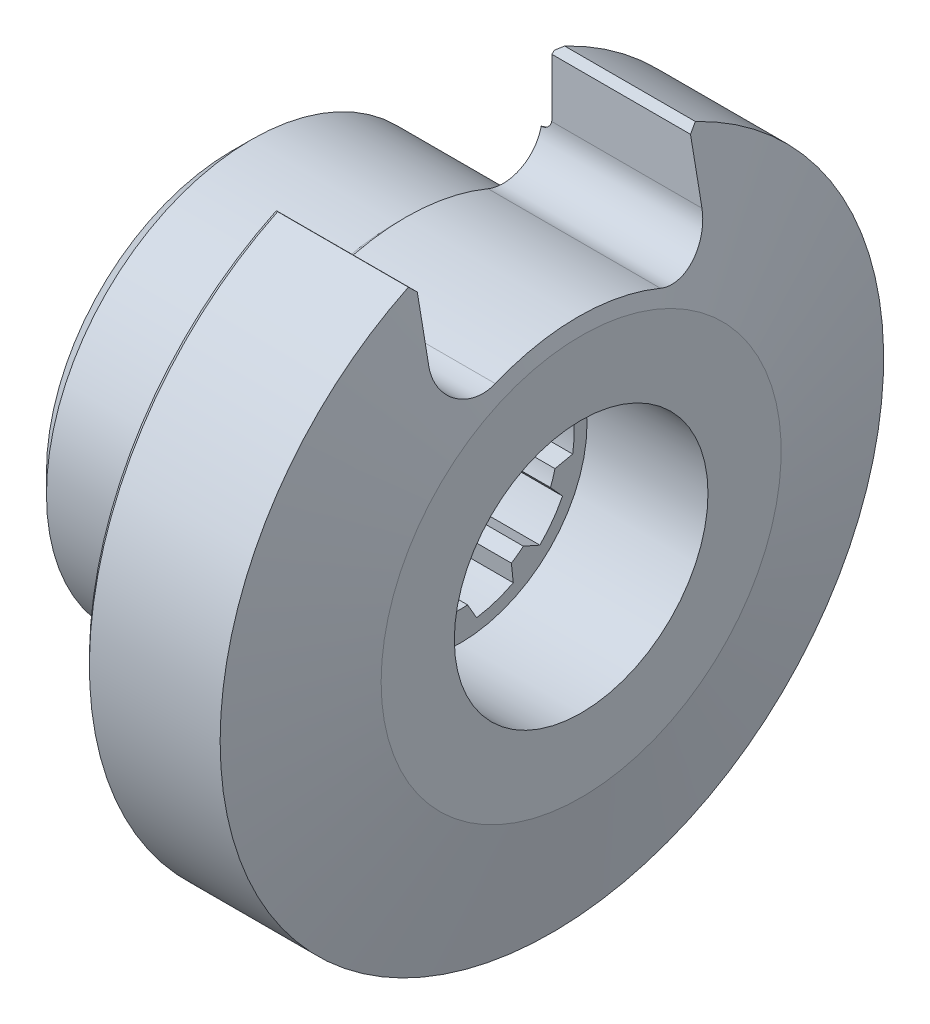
ISO-10303-21;
HEADER;
FILE_DESCRIPTION(('STEP AP214'),'2;1');
FILE_NAME('part.step','',(''),(''),'','','');
FILE_SCHEMA(('AUTOMOTIVE_DESIGN { 1 0 10303 214 1 1 1 1 }'));
ENDSEC;
DATA;
#1=APPLICATION_CONTEXT('core data for automotive mechanical design processes');
#2=APPLICATION_PROTOCOL_DEFINITION('international standard','automotive_design',2000,#1);
#3=PRODUCT_CONTEXT('',#1,'mechanical');
#4=PRODUCT('Part','Part','',(#3));
#5=PRODUCT_RELATED_PRODUCT_CATEGORY('part','',(#4));
#6=PRODUCT_DEFINITION_FORMATION('','',#4);
#7=PRODUCT_DEFINITION_CONTEXT('part definition',#1,'design');
#8=PRODUCT_DEFINITION('design','',#6,#7);
#9=PRODUCT_DEFINITION_SHAPE('','',#8);
#10=(LENGTH_UNIT() NAMED_UNIT(*) SI_UNIT(.MILLI.,.METRE.));
#11=(NAMED_UNIT(*) PLANE_ANGLE_UNIT() SI_UNIT($,.RADIAN.));
#12=(NAMED_UNIT(*) SI_UNIT($,.STERADIAN.) SOLID_ANGLE_UNIT());
#13=UNCERTAINTY_MEASURE_WITH_UNIT(LENGTH_MEASURE(1.E-05),#10,'distance_accuracy_value','');
#14=(GEOMETRIC_REPRESENTATION_CONTEXT(3) GLOBAL_UNCERTAINTY_ASSIGNED_CONTEXT((#13)) GLOBAL_UNIT_ASSIGNED_CONTEXT((#10,
#11,#12)) REPRESENTATION_CONTEXT('',''));
#15=CARTESIAN_POINT('',(0.,0.,0.));
#16=DIRECTION('',(0.,0.,1.));
#17=DIRECTION('',(1.,0.,0.));
#18=AXIS2_PLACEMENT_3D('',#15,#16,#17);
#19=CARTESIAN_POINT('',(-110.,0.,0.));
#20=DIRECTION('',(-1.,0.,0.));
#21=DIRECTION('',(0.,0.,1.));
#22=AXIS2_PLACEMENT_3D('',#19,#20,#21);
#23=CYLINDRICAL_SURFACE('',#22,5.);
#24=CARTESIAN_POINT('',(-6.2,0.,0.));
#25=DIRECTION('',(1.,0.,0.));
#26=DIRECTION('',(0.,0.,-1.));
#27=AXIS2_PLACEMENT_3D('',#24,#25,#26);
#28=CIRCLE('',#27,5.);
#29=CARTESIAN_POINT('',(-6.2,4.25605990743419,-2.62411014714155));
#30=VERTEX_POINT('',#29);
#31=CARTESIAN_POINT('',(-6.2,3.81087189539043,-3.23685887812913));
#32=VERTEX_POINT('',#31);
#33=EDGE_CURVE('E1045',#30,#32,#28,.F.);
#34=ORIENTED_EDGE('',*,*,#33,.F.);
#35=DIRECTION('',(-1.,0.,0.));
#36=VECTOR('',#35,1.);
#37=CARTESIAN_POINT('',(-110.,4.25605990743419,-2.62411014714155));
#38=LINE('',#37,#36);
#39=CARTESIAN_POINT('',(-17.9,4.25605990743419,-2.62411014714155));
#40=VERTEX_POINT('',#39);
#41=EDGE_CURVE('E705',#30,#40,#38,.T.);
#42=ORIENTED_EDGE('',*,*,#41,.T.);
#43=CARTESIAN_POINT('',(-17.9,0.,0.));
#44=DIRECTION('',(-1.,0.,0.));
#45=DIRECTION('',(0.,0.,1.));
#46=AXIS2_PLACEMENT_3D('',#43,#44,#45);
#47=CIRCLE('',#46,5.);
#48=CARTESIAN_POINT('',(-17.9,3.81087189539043,-3.23685887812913));
#49=VERTEX_POINT('',#48);
#50=EDGE_CURVE('E1106',#40,#49,#47,.T.);
#51=ORIENTED_EDGE('',*,*,#50,.T.);
#52=DIRECTION('',(-1.,0.,0.));
#53=VECTOR('',#52,1.);
#54=CARTESIAN_POINT('',(-110.,3.81087189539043,-3.23685887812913));
#55=LINE('',#54,#53);
#56=EDGE_CURVE('E717',#49,#32,#55,.F.);
#57=ORIENTED_EDGE('',*,*,#56,.T.);
#58=EDGE_LOOP('',(#34,#42,#51,#57));
#59=FACE_BOUND('',#58,.T.);
#60=ADVANCED_FACE('F357',(#59),#23,.F.);
#61=CARTESIAN_POINT('',(-6.2,1.90081154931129,-4.62459895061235));
#62=VERTEX_POINT('',#61);
#63=CARTESIAN_POINT('',(-6.2,1.18048221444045,-4.85864813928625));
#64=VERTEX_POINT('',#63);
#65=EDGE_CURVE('E1050',#62,#64,#28,.F.);
#66=ORIENTED_EDGE('',*,*,#65,.F.);
#67=DIRECTION('',(-1.,0.,0.));
#68=VECTOR('',#67,1.);
#69=CARTESIAN_POINT('',(-110.,1.90081154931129,-4.62459895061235));
#70=LINE('',#69,#68);
#71=CARTESIAN_POINT('',(-17.9,1.90081154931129,-4.62459895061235));
#72=VERTEX_POINT('',#71);
#73=EDGE_CURVE('E721',#62,#72,#70,.T.);
#74=ORIENTED_EDGE('',*,*,#73,.T.);
#75=CARTESIAN_POINT('',(-17.9,1.18048221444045,-4.85864813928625));
#76=VERTEX_POINT('',#75);
#77=EDGE_CURVE('E1264',#72,#76,#47,.T.);
#78=ORIENTED_EDGE('',*,*,#77,.T.);
#79=DIRECTION('',(-1.,0.,0.));
#80=VECTOR('',#79,1.);
#81=CARTESIAN_POINT('',(-110.,1.18048221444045,-4.85864813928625));
#82=LINE('',#81,#80);
#83=EDGE_CURVE('E735',#76,#64,#82,.F.);
#84=ORIENTED_EDGE('',*,*,#83,.T.);
#85=EDGE_LOOP('',(#66,#74,#78,#84));
#86=FACE_BOUND('',#85,.T.);
#87=ADVANCED_FACE('F1036',(#86),#23,.F.);
#88=CARTESIAN_POINT('',(-6.2,-1.18048221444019,-4.85864813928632));
#89=VERTEX_POINT('',#88);
#90=CARTESIAN_POINT('',(-6.2,-1.90081154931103,-4.62459895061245));
#91=VERTEX_POINT('',#90);
#92=EDGE_CURVE('E1054',#89,#91,#28,.F.);
#93=ORIENTED_EDGE('',*,*,#92,.F.);
#94=DIRECTION('',(-1.,0.,0.));
#95=VECTOR('',#94,1.);
#96=CARTESIAN_POINT('',(-110.,-1.18048221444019,-4.85864813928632));
#97=LINE('',#96,#95);
#98=CARTESIAN_POINT('',(-17.9,-1.18048221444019,-4.85864813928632));
#99=VERTEX_POINT('',#98);
#100=EDGE_CURVE('E739',#89,#99,#97,.T.);
#101=ORIENTED_EDGE('',*,*,#100,.T.);
#102=CARTESIAN_POINT('',(-17.9,-1.90081154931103,-4.62459895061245));
#103=VERTEX_POINT('',#102);
#104=EDGE_CURVE('E1260',#99,#103,#47,.T.);
#105=ORIENTED_EDGE('',*,*,#104,.T.);
#106=DIRECTION('',(-1.,0.,0.));
#107=VECTOR('',#106,1.);
#108=CARTESIAN_POINT('',(-110.,-1.90081154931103,-4.62459895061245));
#109=LINE('',#108,#107);
#110=EDGE_CURVE('E753',#103,#91,#109,.F.);
#111=ORIENTED_EDGE('',*,*,#110,.T.);
#112=EDGE_LOOP('',(#93,#101,#105,#111));
#113=FACE_BOUND('',#112,.T.);
#114=ADVANCED_FACE('F1042',(#113),#23,.F.);
#115=CARTESIAN_POINT('',(-6.2,-3.81087189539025,-3.23685887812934));
#116=VERTEX_POINT('',#115);
#117=CARTESIAN_POINT('',(-6.2,-4.25605990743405,-2.62411014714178));
#118=VERTEX_POINT('',#117);
#119=EDGE_CURVE('E1059',#116,#118,#28,.F.);
#120=ORIENTED_EDGE('',*,*,#119,.F.);
#121=DIRECTION('',(-1.,0.,0.));
#122=VECTOR('',#121,1.);
#123=CARTESIAN_POINT('',(-110.,-3.81087189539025,-3.23685887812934));
#124=LINE('',#123,#122);
#125=CARTESIAN_POINT('',(-17.9,-3.81087189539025,-3.23685887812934));
#126=VERTEX_POINT('',#125);
#127=EDGE_CURVE('E757',#116,#126,#124,.T.);
#128=ORIENTED_EDGE('',*,*,#127,.T.);
#129=CARTESIAN_POINT('',(-17.9,-4.25605990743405,-2.62411014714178));
#130=VERTEX_POINT('',#129);
#131=EDGE_CURVE('E1256',#126,#130,#47,.T.);
#132=ORIENTED_EDGE('',*,*,#131,.T.);
#133=DIRECTION('',(-1.,0.,0.));
#134=VECTOR('',#133,1.);
#135=CARTESIAN_POINT('',(-110.,-4.25605990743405,-2.62411014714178));
#136=LINE('',#135,#134);
#137=EDGE_CURVE('E771',#130,#118,#136,.F.);
#138=ORIENTED_EDGE('',*,*,#137,.T.);
#139=EDGE_LOOP('',(#120,#128,#132,#138));
#140=FACE_BOUND('',#139,.T.);
#141=ADVANCED_FACE('F1299',(#140),#23,.F.);
#142=CARTESIAN_POINT('',(-6.2,-4.98563803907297,-0.378699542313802));
#143=VERTEX_POINT('',#142);
#144=CARTESIAN_POINT('',(-6.2,-4.98563803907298,0.378699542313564));
#145=VERTEX_POINT('',#144);
#146=EDGE_CURVE('E1064',#143,#145,#28,.F.);
#147=ORIENTED_EDGE('',*,*,#146,.F.);
#148=DIRECTION('',(-1.,0.,0.));
#149=VECTOR('',#148,1.);
#150=CARTESIAN_POINT('',(-110.,-4.98563803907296,-0.378699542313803));
#151=LINE('',#150,#149);
#152=CARTESIAN_POINT('',(-17.9,-4.98563803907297,-0.378699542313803));
#153=VERTEX_POINT('',#152);
#154=EDGE_CURVE('E775',#143,#153,#151,.T.);
#155=ORIENTED_EDGE('',*,*,#154,.T.);
#156=CARTESIAN_POINT('',(-17.9,-4.98563803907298,0.378699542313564));
#157=VERTEX_POINT('',#156);
#158=EDGE_CURVE('E1252',#153,#157,#47,.T.);
#159=ORIENTED_EDGE('',*,*,#158,.T.);
#160=DIRECTION('',(-1.,0.,0.));
#161=VECTOR('',#160,1.);
#162=CARTESIAN_POINT('',(-110.,-4.98563803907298,0.378699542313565));
#163=LINE('',#162,#161);
#164=EDGE_CURVE('E789',#157,#145,#163,.F.);
#165=ORIENTED_EDGE('',*,*,#164,.T.);
#166=EDGE_LOOP('',(#147,#155,#159,#165));
#167=FACE_BOUND('',#166,.T.);
#168=ADVANCED_FACE('F1310',(#167),#23,.F.);
#169=CARTESIAN_POINT('',(-6.2,-4.25605990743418,2.62411014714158));
#170=VERTEX_POINT('',#169);
#171=CARTESIAN_POINT('',(-6.2,-3.8108718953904,3.23685887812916));
#172=VERTEX_POINT('',#171);
#173=EDGE_CURVE('E1069',#170,#172,#28,.F.);
#174=ORIENTED_EDGE('',*,*,#173,.F.);
#175=DIRECTION('',(-1.,0.,0.));
#176=VECTOR('',#175,1.);
#177=CARTESIAN_POINT('',(-110.,-4.25605990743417,2.62411014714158));
#178=LINE('',#177,#176);
#179=CARTESIAN_POINT('',(-17.9,-4.25605990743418,2.62411014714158));
#180=VERTEX_POINT('',#179);
#181=EDGE_CURVE('E793',#170,#180,#178,.T.);
#182=ORIENTED_EDGE('',*,*,#181,.T.);
#183=CARTESIAN_POINT('',(-17.9,-3.81087189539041,3.23685887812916));
#184=VERTEX_POINT('',#183);
#185=EDGE_CURVE('E1248',#180,#184,#47,.T.);
#186=ORIENTED_EDGE('',*,*,#185,.T.);
#187=DIRECTION('',(-1.,0.,0.));
#188=VECTOR('',#187,1.);
#189=CARTESIAN_POINT('',(-110.,-3.8108718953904,3.23685887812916));
#190=LINE('',#189,#188);
#191=EDGE_CURVE('E807',#184,#172,#190,.F.);
#192=ORIENTED_EDGE('',*,*,#191,.T.);
#193=EDGE_LOOP('',(#174,#182,#186,#192));
#194=FACE_BOUND('',#193,.T.);
#195=ADVANCED_FACE('F1321',(#194),#23,.F.);
#196=CARTESIAN_POINT('',(-6.2,-1.90081154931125,4.62459895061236));
#197=VERTEX_POINT('',#196);
#198=CARTESIAN_POINT('',(-6.2,-1.18048221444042,4.85864813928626));
#199=VERTEX_POINT('',#198);
#200=EDGE_CURVE('E1074',#197,#199,#28,.F.);
#201=ORIENTED_EDGE('',*,*,#200,.F.);
#202=DIRECTION('',(-1.,0.,0.));
#203=VECTOR('',#202,1.);
#204=CARTESIAN_POINT('',(-110.,-1.90081154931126,4.62459895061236));
#205=LINE('',#204,#203);
#206=CARTESIAN_POINT('',(-17.9,-1.90081154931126,4.62459895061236));
#207=VERTEX_POINT('',#206);
#208=EDGE_CURVE('E811',#197,#207,#205,.T.);
#209=ORIENTED_EDGE('',*,*,#208,.T.);
#210=CARTESIAN_POINT('',(-17.9,-1.18048221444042,4.85864813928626));
#211=VERTEX_POINT('',#210);
#212=EDGE_CURVE('E1244',#207,#211,#47,.T.);
#213=ORIENTED_EDGE('',*,*,#212,.T.);
#214=DIRECTION('',(-1.,0.,0.));
#215=VECTOR('',#214,1.);
#216=CARTESIAN_POINT('',(-110.,-1.18048221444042,4.85864813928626));
#217=LINE('',#216,#215);
#218=EDGE_CURVE('E825',#211,#199,#217,.F.);
#219=ORIENTED_EDGE('',*,*,#218,.T.);
#220=EDGE_LOOP('',(#201,#209,#213,#219));
#221=FACE_BOUND('',#220,.T.);
#222=ADVANCED_FACE('F1332',(#221),#23,.F.);
#223=CARTESIAN_POINT('',(-6.2,1.18048221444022,4.85864813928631));
#224=VERTEX_POINT('',#223);
#225=CARTESIAN_POINT('',(-6.2,1.90081154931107,4.62459895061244));
#226=VERTEX_POINT('',#225);
#227=EDGE_CURVE('E1079',#224,#226,#28,.F.);
#228=ORIENTED_EDGE('',*,*,#227,.F.);
#229=DIRECTION('',(-1.,0.,0.));
#230=VECTOR('',#229,1.);
#231=CARTESIAN_POINT('',(-110.,1.18048221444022,4.85864813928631));
#232=LINE('',#231,#230);
#233=CARTESIAN_POINT('',(-17.9,1.18048221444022,4.85864813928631));
#234=VERTEX_POINT('',#233);
#235=EDGE_CURVE('E829',#224,#234,#232,.T.);
#236=ORIENTED_EDGE('',*,*,#235,.T.);
#237=CARTESIAN_POINT('',(-17.9,1.90081154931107,4.62459895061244));
#238=VERTEX_POINT('',#237);
#239=EDGE_CURVE('E1243',#234,#238,#47,.T.);
#240=ORIENTED_EDGE('',*,*,#239,.T.);
#241=DIRECTION('',(-1.,0.,0.));
#242=VECTOR('',#241,1.);
#243=CARTESIAN_POINT('',(-110.,1.90081154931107,4.62459895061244));
#244=LINE('',#243,#242);
#245=EDGE_CURVE('E843',#238,#226,#244,.F.);
#246=ORIENTED_EDGE('',*,*,#245,.T.);
#247=EDGE_LOOP('',(#228,#236,#240,#246));
#248=FACE_BOUND('',#247,.T.);
#249=ADVANCED_FACE('F1343',(#248),#23,.F.);
#250=CARTESIAN_POINT('',(-6.2,3.81087189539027,3.23685887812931));
#251=VERTEX_POINT('',#250);
#252=CARTESIAN_POINT('',(-6.2,4.25605990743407,2.62411014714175));
#253=VERTEX_POINT('',#252);
#254=EDGE_CURVE('E1053',#251,#253,#28,.F.);
#255=ORIENTED_EDGE('',*,*,#254,.F.);
#256=DIRECTION('',(-1.,0.,0.));
#257=VECTOR('',#256,1.);
#258=CARTESIAN_POINT('',(-110.,3.81087189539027,3.23685887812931));
#259=LINE('',#258,#257);
#260=CARTESIAN_POINT('',(-17.9,3.81087189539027,3.23685887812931));
#261=VERTEX_POINT('',#260);
#262=EDGE_CURVE('E847',#251,#261,#259,.T.);
#263=ORIENTED_EDGE('',*,*,#262,.T.);
#264=CARTESIAN_POINT('',(-17.9,4.25605990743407,2.62411014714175));
#265=VERTEX_POINT('',#264);
#266=EDGE_CURVE('E1052',#261,#265,#47,.T.);
#267=ORIENTED_EDGE('',*,*,#266,.T.);
#268=DIRECTION('',(-1.,0.,0.));
#269=VECTOR('',#268,1.);
#270=CARTESIAN_POINT('',(-110.,4.25605990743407,2.62411014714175));
#271=LINE('',#270,#269);
#272=EDGE_CURVE('E861',#265,#253,#271,.F.);
#273=ORIENTED_EDGE('',*,*,#272,.T.);
#274=EDGE_LOOP('',(#255,#263,#267,#273));
#275=FACE_BOUND('',#274,.T.);
#276=ADVANCED_FACE('F1022',(#275),#23,.F.);
#277=CARTESIAN_POINT('',(-17.9,4.98563803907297,0.378699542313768));
#278=VERTEX_POINT('',#277);
#279=CARTESIAN_POINT('',(-17.9,4.98563803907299,-0.378699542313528));
#280=VERTEX_POINT('',#279);
#281=EDGE_CURVE('E1103',#278,#280,#47,.T.);
#282=ORIENTED_EDGE('',*,*,#281,.T.);
#283=DIRECTION('',(-1.,0.,0.));
#284=VECTOR('',#283,1.);
#285=CARTESIAN_POINT('',(-110.,4.98563803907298,-0.378699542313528));
#286=LINE('',#285,#284);
#287=CARTESIAN_POINT('',(-6.2,4.98563803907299,-0.378699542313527));
#288=VERTEX_POINT('',#287);
#289=EDGE_CURVE('E693',#280,#288,#286,.F.);
#290=ORIENTED_EDGE('',*,*,#289,.T.);
#291=CARTESIAN_POINT('',(-6.2,4.98563803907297,0.378699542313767));
#292=VERTEX_POINT('',#291);
#293=EDGE_CURVE('E906',#292,#288,#28,.F.);
#294=ORIENTED_EDGE('',*,*,#293,.F.);
#295=DIRECTION('',(-1.,0.,0.));
#296=VECTOR('',#295,1.);
#297=CARTESIAN_POINT('',(-110.,4.98563803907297,0.378699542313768));
#298=LINE('',#297,#296);
#299=EDGE_CURVE('E865',#292,#278,#298,.T.);
#300=ORIENTED_EDGE('',*,*,#299,.T.);
#301=EDGE_LOOP('',(#282,#290,#294,#300));
#302=FACE_BOUND('',#301,.T.);
#303=ADVANCED_FACE('F1020',(#302),#23,.F.);
#304=CARTESIAN_POINT('',(-110.,0.,0.));
#305=DIRECTION('',(-1.,0.,0.));
#306=DIRECTION('',(0.,0.,1.));
#307=AXIS2_PLACEMENT_3D('',#304,#305,#306);
#308=CYLINDRICAL_SURFACE('',#307,10.5);
#309=CARTESIAN_POINT('',(-9.49999999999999,0.,0.));
#310=DIRECTION('',(1.,0.,0.));
#311=DIRECTION('',(0.,0.,-1.));
#312=AXIS2_PLACEMENT_3D('',#309,#310,#311);
#313=CIRCLE('',#312,10.5);
#314=CARTESIAN_POINT('',(-9.49999999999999,0.,-10.5));
#315=VERTEX_POINT('',#314);
#316=EDGE_CURVE('E1126',#315,#315,#313,.F.);
#317=ORIENTED_EDGE('',*,*,#316,.T.);
#318=EDGE_LOOP('',(#317));
#319=FACE_BOUND('',#318,.T.);
#320=CARTESIAN_POINT('',(-16.9,0.,0.));
#321=DIRECTION('',(1.,0.,0.));
#322=DIRECTION('',(0.,0.,-1.));
#323=AXIS2_PLACEMENT_3D('',#320,#321,#322);
#324=CIRCLE('',#323,10.5);
#325=CARTESIAN_POINT('',(-16.9,0.,-10.5));
#326=VERTEX_POINT('',#325);
#327=EDGE_CURVE('E1117',#326,#326,#324,.T.);
#328=ORIENTED_EDGE('',*,*,#327,.T.);
#329=EDGE_LOOP('',(#328));
#330=FACE_BOUND('',#329,.T.);
#331=ADVANCED_FACE('F359',(#319,#330),#308,.T.);
#332=CARTESIAN_POINT('',(-9.,13.5,0.));
#333=DIRECTION('',(1.,0.,0.));
#334=DIRECTION('',(0.,0.,-1.));
#335=AXIS2_PLACEMENT_3D('',#332,#333,#334);
#336=PLANE('',#335);
#337=CARTESIAN_POINT('',(-8.99999999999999,0.,0.));
#338=DIRECTION('',(-1.,0.,0.));
#339=DIRECTION('',(0.,0.,1.));
#340=AXIS2_PLACEMENT_3D('',#337,#338,#339);
#341=CIRCLE('',#340,13.5);
#342=CARTESIAN_POINT('',(-8.99999999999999,11.57143978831,-6.95354450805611));
#343=VERTEX_POINT('',#342);
#344=CARTESIAN_POINT('',(-8.99999999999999,11.57143978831,6.95354450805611));
#345=VERTEX_POINT('',#344);
#346=EDGE_CURVE('E1112',#343,#345,#341,.T.);
#347=ORIENTED_EDGE('',*,*,#346,.T.);
#348=CARTESIAN_POINT('',(-9.,12.,5.));
#349=DIRECTION('',(1.,0.,0.));
#350=DIRECTION('',(0.,0.,-1.));
#351=AXIS2_PLACEMENT_3D('',#348,#349,#350);
#352=CIRCLE('',#351,2.);
#353=CARTESIAN_POINT('',(-9.,10.1538461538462,4.23076923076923));
#354=VERTEX_POINT('',#353);
#355=EDGE_CURVE('E933',#345,#354,#352,.T.);
#356=ORIENTED_EDGE('',*,*,#355,.T.);
#357=CARTESIAN_POINT('',(-9.,0.,0.));
#358=DIRECTION('',(1.,0.,0.));
#359=DIRECTION('',(0.,0.,-1.));
#360=AXIS2_PLACEMENT_3D('',#357,#358,#359);
#361=CIRCLE('',#360,11.);
#362=CARTESIAN_POINT('',(-9.,10.1538461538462,-4.23076923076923));
#363=VERTEX_POINT('',#362);
#364=EDGE_CURVE('E1129',#354,#363,#361,.T.);
#365=ORIENTED_EDGE('',*,*,#364,.T.);
#366=CARTESIAN_POINT('',(-9.,12.,-5.));
#367=DIRECTION('',(1.,0.,0.));
#368=DIRECTION('',(0.,0.,-1.));
#369=AXIS2_PLACEMENT_3D('',#366,#367,#368);
#370=CIRCLE('',#369,2.);
#371=EDGE_CURVE('E967',#363,#343,#370,.T.);
#372=ORIENTED_EDGE('',*,*,#371,.T.);
#373=EDGE_LOOP('',(#347,#356,#365,#372));
#374=FACE_BOUND('',#373,.T.);
#375=ADVANCED_FACE('F1638',(#374),#336,.F.);
#376=CARTESIAN_POINT('',(-8.5,17.,0.));
#377=DIRECTION('',(1.,0.,0.));
#378=DIRECTION('',(0.,0.,-1.));
#379=AXIS2_PLACEMENT_3D('',#376,#377,#378);
#380=PLANE('',#379);
#381=DIRECTION('',(0.,1.,0.));
#382=VECTOR('',#381,1.);
#383=CARTESIAN_POINT('',(-8.5,17.,-7.));
#384=LINE('',#383,#382);
#385=CARTESIAN_POINT('',(-8.5,12.1243556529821,-7.));
#386=VERTEX_POINT('',#385);
#387=CARTESIAN_POINT('',(-8.49999999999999,14.9871694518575,-7.));
#388=VERTEX_POINT('',#387);
#389=EDGE_CURVE('E868',#386,#388,#384,.T.);
#390=ORIENTED_EDGE('',*,*,#389,.T.);
#391=DIRECTION('',(0.,0.695301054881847,-0.718718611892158));
#392=VECTOR('',#391,1.);
#393=CARTESIAN_POINT('',(-8.49999999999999,15.3279118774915,-7.35221854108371));
#394=LINE('',#393,#392);
#395=CARTESIAN_POINT('',(-8.5,15.1051992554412,-7.12200501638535));
#396=VERTEX_POINT('',#395);
#397=EDGE_CURVE('E1000',#388,#396,#394,.T.);
#398=ORIENTED_EDGE('',*,*,#397,.T.);
#399=CARTESIAN_POINT('',(-8.5,0.,0.));
#400=DIRECTION('',(1.,0.,0.));
#401=DIRECTION('',(0.,0.,-1.));
#402=AXIS2_PLACEMENT_3D('',#399,#400,#401);
#403=CIRCLE('',#402,16.7);
#404=CARTESIAN_POINT('',(-8.5,15.1051992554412,7.12200501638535));
#405=VERTEX_POINT('',#404);
#406=EDGE_CURVE('E1120',#396,#405,#403,.F.);
#407=ORIENTED_EDGE('',*,*,#406,.T.);
#408=DIRECTION('',(0.,0.695301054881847,0.718718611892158));
#409=VECTOR('',#408,1.);
#410=CARTESIAN_POINT('',(-8.49999999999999,15.3279118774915,7.35221854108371));
#411=LINE('',#410,#409);
#412=CARTESIAN_POINT('',(-8.5,14.9871694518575,7.));
#413=VERTEX_POINT('',#412);
#414=EDGE_CURVE('E1149',#405,#413,#411,.F.);
#415=ORIENTED_EDGE('',*,*,#414,.T.);
#416=DIRECTION('',(0.,-1.,0.));
#417=VECTOR('',#416,1.);
#418=CARTESIAN_POINT('',(-8.5,17.,7.));
#419=LINE('',#418,#417);
#420=CARTESIAN_POINT('',(-8.49999999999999,12.1243556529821,7.));
#421=VERTEX_POINT('',#420);
#422=EDGE_CURVE('E878',#413,#421,#419,.T.);
#423=ORIENTED_EDGE('',*,*,#422,.T.);
#424=CARTESIAN_POINT('',(-8.5,0.,0.));
#425=DIRECTION('',(1.,0.,0.));
#426=DIRECTION('',(0.,0.,-1.));
#427=AXIS2_PLACEMENT_3D('',#424,#425,#426);
#428=CIRCLE('',#427,14.);
#429=EDGE_CURVE('E905',#421,#386,#428,.T.);
#430=ORIENTED_EDGE('',*,*,#429,.T.);
#431=EDGE_LOOP('',(#390,#398,#407,#415,#423,#430));
#432=FACE_BOUND('',#431,.T.);
#433=ADVANCED_FACE('F1134',(#432),#380,.F.);
#434=CARTESIAN_POINT('',(-110.,0.,0.));
#435=DIRECTION('',(-1.,0.,0.));
#436=DIRECTION('',(0.,0.,1.));
#437=AXIS2_PLACEMENT_3D('',#434,#435,#436);
#438=CYLINDRICAL_SURFACE('',#437,17.);
#439=CARTESIAN_POINT('',(-8.2,0.,0.));
#440=DIRECTION('',(1.,0.,0.));
#441=DIRECTION('',(0.,0.,-1.));
#442=AXIS2_PLACEMENT_3D('',#439,#440,#441);
#443=CIRCLE('',#442,17.);
#444=CARTESIAN_POINT('',(-8.2,15.3279118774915,7.35221854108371));
#445=VERTEX_POINT('',#444);
#446=CARTESIAN_POINT('',(-8.2,15.3279118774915,-7.35221854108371));
#447=VERTEX_POINT('',#446);
#448=EDGE_CURVE('E1123',#445,#447,#443,.T.);
#449=ORIENTED_EDGE('',*,*,#448,.T.);
#450=DIRECTION('',(-1.,0.,0.));
#451=VECTOR('',#450,1.);
#452=CARTESIAN_POINT('',(-110.,15.3279118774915,-7.35221854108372));
#453=LINE('',#452,#451);
#454=CARTESIAN_POINT('',(-1.5,15.3279118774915,-7.35221854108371));
#455=VERTEX_POINT('',#454);
#456=EDGE_CURVE('E970',#447,#455,#453,.F.);
#457=ORIENTED_EDGE('',*,*,#456,.T.);
#458=CARTESIAN_POINT('',(-1.5,0.,0.));
#459=DIRECTION('',(-1.,0.,0.));
#460=DIRECTION('',(0.,0.,1.));
#461=AXIS2_PLACEMENT_3D('',#458,#459,#460);
#462=CIRCLE('',#461,17.);
#463=CARTESIAN_POINT('',(-1.5,15.3279118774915,7.35221854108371));
#464=VERTEX_POINT('',#463);
#465=EDGE_CURVE('E1109',#455,#464,#462,.T.);
#466=ORIENTED_EDGE('',*,*,#465,.T.);
#467=DIRECTION('',(-1.,0.,0.));
#468=VECTOR('',#467,1.);
#469=CARTESIAN_POINT('',(-110.,15.3279118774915,7.35221854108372));
#470=LINE('',#469,#468);
#471=EDGE_CURVE('E966',#464,#445,#470,.T.);
#472=ORIENTED_EDGE('',*,*,#471,.T.);
#473=EDGE_LOOP('',(#449,#457,#466,#472));
#474=FACE_BOUND('',#473,.T.);
#475=ADVANCED_FACE('F1031',(#474),#438,.T.);
#476=CARTESIAN_POINT('',(0.,0.,0.));
#477=DIRECTION('',(-1.,0.,0.));
#478=DIRECTION('',(0.,0.,1.));
#479=AXIS2_PLACEMENT_3D('',#476,#477,#478);
#480=CONICAL_SURFACE('',#479,10.25,1.35212738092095);
#481=ORIENTED_EDGE('',*,*,#465,.F.);
#482=CARTESIAN_POINT('',(-1.5,15.3279118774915,-7.35221854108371));
#483=CARTESIAN_POINT('',(-1.48298031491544,15.2711260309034,-7.29352016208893));
#484=CARTESIAN_POINT('',(-1.46597638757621,15.2143379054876,-7.23481942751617));
#485=CARTESIAN_POINT('',(-1.43200004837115,15.1007570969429,-7.11741324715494));
#486=CARTESIAN_POINT('',(-1.41502763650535,15.043964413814,-7.05870780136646));
#487=CARTESIAN_POINT('',(-1.39807098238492,14.9871694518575,-7.));
#488=B_SPLINE_CURVE_WITH_KNOTS('',3,(#482,#483,#484,#485,#486,#487),.UNSPECIFIED.,.F.,.F.,(4,2,
4),(0.,0.250276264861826,0.500552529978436),.UNSPECIFIED.);
#489=CARTESIAN_POINT('',(-1.39807098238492,14.9871694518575,-7.));
#490=VERTEX_POINT('',#489);
#491=EDGE_CURVE('E978',#455,#490,#488,.T.);
#492=ORIENTED_EDGE('',*,*,#491,.T.);
#493=CARTESIAN_POINT('',(-2.73114329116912,21.4256418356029,-7.));
#494=CARTESIAN_POINT('',(-2.62724937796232,20.9337638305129,-7.));
#495=CARTESIAN_POINT('',(-2.52367173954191,20.441818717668,-7.));
#496=CARTESIAN_POINT('',(-2.31732119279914,19.4577583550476,-7.));
#497=CARTESIAN_POINT('',(-2.21454828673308,18.9656431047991,-7.));
#498=CARTESIAN_POINT('',(-2.01003060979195,17.9814529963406,-7.));
#499=CARTESIAN_POINT('',(-1.90828535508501,17.4893782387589,-7.));
#500=CARTESIAN_POINT('',(-1.70601128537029,16.5049789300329,-7.));
#501=CARTESIAN_POINT('',(-1.60548246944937,16.0126543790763,-7.));
#502=CARTESIAN_POINT('',(-1.40629753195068,15.0293734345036,-7.));
#503=CARTESIAN_POINT('',(-1.30763619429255,14.5384180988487,-7.));
#504=CARTESIAN_POINT('',(-1.11226098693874,13.556119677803,-7.));
#505=CARTESIAN_POINT('',(-1.01554711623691,13.0647765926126,-7.));
#506=CARTESIAN_POINT('',(-0.824600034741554,12.0813267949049,-7.));
#507=CARTESIAN_POINT('',(-0.730368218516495,11.589219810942,-7.));
#508=CARTESIAN_POINT('',(-0.545263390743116,10.6043729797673,-7.));
#509=CARTESIAN_POINT('',(-0.454390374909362,10.1116331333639,-7.));
#510=CARTESIAN_POINT('',(-0.276608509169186,9.12219322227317,-7.));
#511=CARTESIAN_POINT('',(-0.18972860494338,8.62548792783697,-7.));
#512=CARTESIAN_POINT('',(-0.0222708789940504,7.63101896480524,-7.));
#513=CARTESIAN_POINT('',(0.058307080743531,7.13325531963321,-7.));
#514=CARTESIAN_POINT('',(0.210610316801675,6.13698019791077,-7.));
#515=CARTESIAN_POINT('',(0.282346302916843,5.63847038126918,-7.));
#516=CARTESIAN_POINT('',(0.413679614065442,4.6398258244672,-7.));
#517=CARTESIAN_POINT('',(0.473276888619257,4.13969107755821,-7.));
#518=CARTESIAN_POINT('',(0.576166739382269,3.13558337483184,-7.));
#519=CARTESIAN_POINT('',(0.619390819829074,2.63160310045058,-7.));
#520=CARTESIAN_POINT('',(0.668302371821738,1.8746365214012,-7.));
#521=CARTESIAN_POINT('',(0.681951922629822,1.62215742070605,-7.));
#522=CARTESIAN_POINT('',(0.703506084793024,1.11695720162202,-7.));
#523=CARTESIAN_POINT('',(0.711410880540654,0.864236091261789,-7.));
#524=CARTESIAN_POINT('',(0.721208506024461,0.357561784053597,-7.));
#525=CARTESIAN_POINT('',(0.723074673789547,0.10360806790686,-7.));
#526=CARTESIAN_POINT('',(0.720652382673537,-0.40427617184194,-7.));
#527=CARTESIAN_POINT('',(0.716363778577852,-0.658206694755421,-7.));
#528=CARTESIAN_POINT('',(0.701779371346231,-1.16606607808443,-7.));
#529=CARTESIAN_POINT('',(0.691479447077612,-1.41999481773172,-7.));
#530=CARTESIAN_POINT('',(0.665264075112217,-1.92755175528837,-7.));
#531=CARTESIAN_POINT('',(0.649348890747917,-2.18117996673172,-7.));
#532=CARTESIAN_POINT('',(0.630823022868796,-2.43460762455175,-7.));
#533=B_SPLINE_CURVE_WITH_KNOTS('',3,(#493,#494,#495,#496,#497,#498,#499,#500,#501,#502,#503,
#504,#505,#506,#507,#508,#509,#510,#511,#512,#513,#514,#515,#516,#517,#518,#519,#520,#521,#522,
#523,#524,#525,#526,#527,#528,#529,#530,#531,#532),.UNSPECIFIED.,.F.,.F.,(4,2,2,2,2,2,2,2,2,2,2,
2,2,2,2,2,2,2,2,4),(0.,1.50819172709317,3.01638768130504,4.52383693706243,6.03128506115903,
7.53359386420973,9.03590189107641,10.5390367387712,12.0421696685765,13.5548794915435,
15.0675561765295,16.5783822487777,18.0892146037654,19.6062993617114,20.3647870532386,
21.1232503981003,21.88505800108,22.6468835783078,23.409232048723,24.1715447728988),.UNSPECIFIED.);
#534=CARTESIAN_POINT('',(-0.809431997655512,12.,-7.));
#535=VERTEX_POINT('',#534);
#536=EDGE_CURVE('E871',#490,#535,#533,.T.);
#537=ORIENTED_EDGE('',*,*,#536,.T.);
#538=CARTESIAN_POINT('',(-0.809431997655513,12.,-7.));
#539=CARTESIAN_POINT('',(-0.798372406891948,11.9423826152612,-6.99999939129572));
#540=CARTESIAN_POINT('',(-0.78706864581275,11.8848424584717,-6.99750875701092));
#541=CARTESIAN_POINT('',(-0.764032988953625,11.7702816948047,-6.98759609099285));
#542=CARTESIAN_POINT('',(-0.752301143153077,11.7132610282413,-6.98017463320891));
#543=CARTESIAN_POINT('',(-0.716592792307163,11.5437097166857,-6.9506216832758));
#544=CARTESIAN_POINT('',(-0.692063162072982,11.4324793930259,-6.92120123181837));
#545=CARTESIAN_POINT('',(-0.642197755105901,11.2168899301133,-6.84387470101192));
#546=CARTESIAN_POINT('',(-0.61686187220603,11.1125317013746,-6.7959661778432));
#547=CARTESIAN_POINT('',(-0.566047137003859,10.9135414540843,-6.68305851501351));
#548=CARTESIAN_POINT('',(-0.54056829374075,10.8189088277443,-6.6180604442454));
#549=CARTESIAN_POINT('',(-0.490039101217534,10.6414738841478,-6.47230273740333));
#550=CARTESIAN_POINT('',(-0.464992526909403,10.5587509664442,-6.39144510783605));
#551=CARTESIAN_POINT('',(-0.416293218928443,10.4082709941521,-6.2164360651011));
#552=CARTESIAN_POINT('',(-0.39264068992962,10.340516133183,-6.12228270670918));
#553=CARTESIAN_POINT('',(-0.34772929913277,10.2224811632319,-5.92393648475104));
#554=CARTESIAN_POINT('',(-0.326455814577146,10.172089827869,-5.81981319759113));
#555=CARTESIAN_POINT('',(-0.286979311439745,10.0898689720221,-5.60393115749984));
#556=CARTESIAN_POINT('',(-0.268775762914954,10.0580362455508,-5.49217372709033));
#557=CARTESIAN_POINT('',(-0.236630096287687,10.0146450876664,-5.26688806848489));
#558=CARTESIAN_POINT('',(-0.222600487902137,10.0026420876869,-5.15345789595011));
#559=CARTESIAN_POINT('',(-0.198938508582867,9.99814266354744,-4.92577226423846));
#560=CARTESIAN_POINT('',(-0.189303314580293,10.0056336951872,-4.81151738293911));
#561=CARTESIAN_POINT('',(-0.177012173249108,10.0350544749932,-4.61845205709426));
#562=CARTESIAN_POINT('',(-0.173143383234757,10.0521780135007,-4.53895352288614));
#563=CARTESIAN_POINT('',(-0.167966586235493,10.095945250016,-4.38260056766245));
#564=CARTESIAN_POINT('',(-0.16665668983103,10.1225819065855,-4.30574423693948));
#565=CARTESIAN_POINT('',(-0.166666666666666,10.1538461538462,-4.23076923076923));
#566=B_SPLINE_CURVE_WITH_KNOTS('',3,(#538,#539,#540,#541,#542,#543,#544,#545,#546,#547,#548,
#549,#550,#551,#552,#553,#554,#555,#556,#557,#558,#559,#560,#561,#562,#563,#564,#565),
.UNSPECIFIED.,.F.,.F.,(4,2,2,2,2,2,2,2,2,2,2,2,2,4),(0.,0.175896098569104,0.351771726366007,
0.702888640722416,1.05405198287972,1.40519336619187,1.75857692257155,2.11201223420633,
2.46313949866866,2.81420608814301,3.157289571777,3.50015233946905,3.74378599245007,
3.98723968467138),.UNSPECIFIED.);
#567=CARTESIAN_POINT('',(-0.166666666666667,10.1538461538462,-4.23076923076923));
#568=VERTEX_POINT('',#567);
#569=EDGE_CURVE('E955',#535,#568,#566,.T.);
#570=ORIENTED_EDGE('',*,*,#569,.T.);
#571=CARTESIAN_POINT('',(-0.166666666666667,0.,0.));
#572=DIRECTION('',(-1.,0.,0.));
#573=DIRECTION('',(0.,0.,1.));
#574=AXIS2_PLACEMENT_3D('',#571,#572,#573);
#575=CIRCLE('',#574,11.);
#576=CARTESIAN_POINT('',(-0.166666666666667,10.1538461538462,4.23076923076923));
#577=VERTEX_POINT('',#576);
#578=EDGE_CURVE('E1099',#568,#577,#575,.F.);
#579=ORIENTED_EDGE('',*,*,#578,.T.);
#580=CARTESIAN_POINT('',(-0.166666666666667,10.1538461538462,4.23076923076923));
#581=CARTESIAN_POINT('',(-0.166665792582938,10.1326890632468,4.28154467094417));
#582=CARTESIAN_POINT('',(-0.167263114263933,10.1136395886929,4.3331691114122));
#583=CARTESIAN_POINT('',(-0.16963978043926,10.0798617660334,4.43777919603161));
#584=CARTESIAN_POINT('',(-0.171418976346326,10.065132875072,4.49076466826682));
#585=CARTESIAN_POINT('',(-0.1784959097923,10.0276430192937,4.65100208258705));
#586=CARTESIAN_POINT('',(-0.185533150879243,10.0114691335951,4.75979938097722));
#587=CARTESIAN_POINT('',(-0.203900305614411,9.99712351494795,4.97815604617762));
#588=CARTESIAN_POINT('',(-0.215230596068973,9.99895336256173,5.08771547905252));
#589=CARTESIAN_POINT('',(-0.241657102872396,10.0203355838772,5.30463577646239));
#590=CARTESIAN_POINT('',(-0.256753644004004,10.0398894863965,5.41199645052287));
#591=CARTESIAN_POINT('',(-0.290334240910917,10.0964141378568,5.62330702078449));
#592=CARTESIAN_POINT('',(-0.308867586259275,10.1336525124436,5.72717730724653));
#593=CARTESIAN_POINT('',(-0.348438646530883,10.2244269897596,5.92703401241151));
#594=CARTESIAN_POINT('',(-0.369477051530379,10.2779675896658,6.02301824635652));
#595=CARTESIAN_POINT('',(-0.4139724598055,10.4015774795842,6.20736049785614));
#596=CARTESIAN_POINT('',(-0.437482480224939,10.472087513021,6.29541026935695));
#597=CARTESIAN_POINT('',(-0.485606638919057,10.6266806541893,6.4582879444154));
#598=CARTESIAN_POINT('',(-0.510220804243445,10.7107640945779,6.53311552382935));
#599=CARTESIAN_POINT('',(-0.560361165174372,10.8921222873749,6.66904812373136));
#600=CARTESIAN_POINT('',(-0.585895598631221,10.989641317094,6.72982434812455));
#601=CARTESIAN_POINT('',(-0.636642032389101,11.193700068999,6.83384671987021));
#602=CARTESIAN_POINT('',(-0.661854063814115,11.3002389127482,6.87709457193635));
#603=CARTESIAN_POINT('',(-0.708055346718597,11.505003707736,6.94033661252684));
#604=CARTESIAN_POINT('',(-0.72916617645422,11.6024990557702,6.96262952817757));
#605=CARTESIAN_POINT('',(-0.770248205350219,11.7999310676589,6.99248238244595));
#606=CARTESIAN_POINT('',(-0.790219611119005,11.8998672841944,7.00004500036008));
#607=CARTESIAN_POINT('',(-0.809431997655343,11.9999999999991,7.));
#608=B_SPLINE_CURVE_WITH_KNOTS('',3,(#580,#581,#582,#583,#584,#585,#586,#587,#588,#589,#590,
#591,#592,#593,#594,#595,#596,#597,#598,#599,#600,#601,#602,#603,#604,#605,#606,#607),
.UNSPECIFIED.,.F.,.F.,(4,2,2,2,2,2,2,2,2,2,2,2,2,4),(0.,0.16491764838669,0.329814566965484,
0.658760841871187,0.987735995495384,1.31673952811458,1.65088885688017,1.98513044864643,
2.32922568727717,2.67332936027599,3.0248144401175,3.37626532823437,3.68183290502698,
3.98734489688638),.UNSPECIFIED.);
#609=CARTESIAN_POINT('',(-0.809431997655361,11.9999999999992,7.));
#610=VERTEX_POINT('',#609);
#611=EDGE_CURVE('E934',#577,#610,#608,.T.);
#612=ORIENTED_EDGE('',*,*,#611,.T.);
#613=CARTESIAN_POINT('',(0.630823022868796,-2.43460762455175,7.));
#614=CARTESIAN_POINT('',(0.642332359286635,-2.27696844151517,7.));
#615=CARTESIAN_POINT('',(0.652846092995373,-2.11925735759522,7.));
#616=CARTESIAN_POINT('',(0.671766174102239,-1.80370571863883,7.));
#617=CARTESIAN_POINT('',(0.680172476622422,-1.64586516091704,7.));
#618=CARTESIAN_POINT('',(0.702055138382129,-1.1721839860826,7.));
#619=CARTESIAN_POINT('',(0.712195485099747,-0.856180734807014,7.));
#620=CARTESIAN_POINT('',(0.722993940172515,-0.224498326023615,7.));
#621=CARTESIAN_POINT('',(0.723666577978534,0.0911805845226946,7.));
#622=CARTESIAN_POINT('',(0.715528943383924,0.722405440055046,7.));
#623=CARTESIAN_POINT('',(0.706718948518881,1.03795138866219,7.));
#624=CARTESIAN_POINT('',(0.680183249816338,1.66711318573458,7.));
#625=CARTESIAN_POINT('',(0.662501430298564,1.98073091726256,7.));
#626=CARTESIAN_POINT('',(0.619131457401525,2.60740978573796,7.));
#627=CARTESIAN_POINT('',(0.59344308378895,2.92047090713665,7.));
#628=CARTESIAN_POINT('',(0.506018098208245,3.85886351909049,7.));
#629=CARTESIAN_POINT('',(0.433930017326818,4.48323241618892,7.));
#630=CARTESIAN_POINT('',(0.302907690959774,5.48359510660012,7.));
#631=CARTESIAN_POINT('',(0.249999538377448,5.86042344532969,7.));
#632=CARTESIAN_POINT('',(0.138715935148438,6.61321934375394,7.));
#633=CARTESIAN_POINT('',(0.0803412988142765,6.98918702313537,7.));
#634=CARTESIAN_POINT('',(-0.0407617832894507,7.74103028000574,7.));
#635=CARTESIAN_POINT('',(-0.103497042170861,8.11690474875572,7.));
#636=CARTESIAN_POINT('',(-0.232311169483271,8.8680930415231,7.));
#637=CARTESIAN_POINT('',(-0.298390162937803,9.243406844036,7.));
#638=CARTESIAN_POINT('',(-0.454712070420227,10.1134387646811,7.));
#639=CARTESIAN_POINT('',(-0.545928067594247,10.6079815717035,7.));
#640=CARTESIAN_POINT('',(-0.73173778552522,11.5964337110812,7.));
#641=CARTESIAN_POINT('',(-0.826331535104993,12.0903430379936,7.));
#642=CARTESIAN_POINT('',(-1.01807180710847,13.0776792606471,7.));
#643=CARTESIAN_POINT('',(-1.115218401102,13.5711061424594,7.));
#644=CARTESIAN_POINT('',(-1.31146966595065,14.5575705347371,7.));
#645=CARTESIAN_POINT('',(-1.41057434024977,15.050608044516,7.));
#646=CARTESIAN_POINT('',(-1.60986665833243,16.0341697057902,7.));
#647=CARTESIAN_POINT('',(-1.71004748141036,16.5246952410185,7.));
#648=CARTESIAN_POINT('',(-1.91161354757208,17.5054992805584,7.));
#649=CARTESIAN_POINT('',(-2.01299879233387,17.995777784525,7.));
#650=CARTESIAN_POINT('',(-2.2167264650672,18.9760827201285,7.));
#651=CARTESIAN_POINT('',(-2.31906879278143,19.4661091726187,7.));
#652=CARTESIAN_POINT('',(-2.52455060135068,20.4459932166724,7.));
#653=CARTESIAN_POINT('',(-2.62769007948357,20.9358508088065,7.));
#654=CARTESIAN_POINT('',(-2.73114329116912,21.4256418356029,7.));
#655=B_SPLINE_CURVE_WITH_KNOTS('',3,(#613,#614,#615,#616,#617,#618,#619,#620,#621,#622,#623,
#624,#625,#626,#627,#628,#629,#630,#631,#632,#633,#634,#635,#636,#637,#638,#639,#640,#641,#642,
#643,#644,#645,#646,#647,#648,#649,#650,#651,#652,#653,#654),.UNSPECIFIED.,.F.,.F.,(4,2,2,2,2,2,
2,2,2,2,2,2,2,2,2,2,2,2,2,2,4),(0.,0.474170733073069,0.948351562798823,1.89670380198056,
2.84360051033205,3.79046950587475,4.73270033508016,5.67495708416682,7.55998620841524,
8.70153541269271,9.84291483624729,10.9861194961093,12.1293669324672,13.6380040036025,
15.1466539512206,16.6553462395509,18.1640411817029,19.6659925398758,21.1679459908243,
22.6697438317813,24.1715365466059),.UNSPECIFIED.);
#656=CARTESIAN_POINT('',(-1.39807098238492,14.9871694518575,7.));
#657=VERTEX_POINT('',#656);
#658=EDGE_CURVE('E1697',#610,#657,#655,.T.);
#659=ORIENTED_EDGE('',*,*,#658,.T.);
#660=CARTESIAN_POINT('',(-1.39807098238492,14.9871694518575,7.));
#661=CARTESIAN_POINT('',(-1.41502763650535,15.043964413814,7.05870780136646));
#662=CARTESIAN_POINT('',(-1.43200004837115,15.1007570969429,7.11741324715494));
#663=CARTESIAN_POINT('',(-1.46597638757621,15.2143379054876,7.23481942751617));
#664=CARTESIAN_POINT('',(-1.48298031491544,15.2711260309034,7.29352016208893));
#665=CARTESIAN_POINT('',(-1.5,15.3279118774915,7.35221854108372));
#666=B_SPLINE_CURVE_WITH_KNOTS('',3,(#660,#661,#662,#663,#664,#665),.UNSPECIFIED.,.F.,.F.,(4,2,
4),(0.,0.250276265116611,0.50055252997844),.UNSPECIFIED.);
#667=EDGE_CURVE('E973',#657,#464,#666,.T.);
#668=ORIENTED_EDGE('',*,*,#667,.T.);
#669=EDGE_LOOP('',(#481,#492,#537,#570,#579,#612,#659,#668));
#670=FACE_BOUND('',#669,.T.);
#671=CARTESIAN_POINT('',(0.,0.,0.));
#672=DIRECTION('',(-1.,0.,0.));
#673=DIRECTION('',(0.,0.,1.));
#674=AXIS2_PLACEMENT_3D('',#671,#672,#673);
#675=CIRCLE('',#674,10.25);
#676=CARTESIAN_POINT('',(0.,0.,10.25));
#677=VERTEX_POINT('',#676);
#678=EDGE_CURVE('E1105',#677,#677,#675,.T.);
#679=ORIENTED_EDGE('',*,*,#678,.T.);
#680=EDGE_LOOP('',(#679));
#681=FACE_BOUND('',#680,.T.);
#682=ADVANCED_FACE('F880',(#670,#681),#480,.T.);
#683=CARTESIAN_POINT('',(0.,10.25,0.));
#684=DIRECTION('',(-1.,0.,0.));
#685=DIRECTION('',(0.,0.,1.));
#686=AXIS2_PLACEMENT_3D('',#683,#684,#685);
#687=PLANE('',#686);
#688=CARTESIAN_POINT('',(0.,0.,0.));
#689=DIRECTION('',(1.,0.,0.));
#690=DIRECTION('',(0.,0.,-1.));
#691=AXIS2_PLACEMENT_3D('',#688,#689,#690);
#692=CIRCLE('',#691,6.5);
#693=CARTESIAN_POINT('',(0.,0.,-6.5));
#694=VERTEX_POINT('',#693);
#695=EDGE_CURVE('E1094',#694,#694,#692,.T.);
#696=ORIENTED_EDGE('',*,*,#695,.F.);
#697=EDGE_LOOP('',(#696));
#698=FACE_BOUND('',#697,.T.);
#699=ORIENTED_EDGE('',*,*,#678,.F.);
#700=EDGE_LOOP('',(#699));
#701=FACE_BOUND('',#700,.T.);
#702=ADVANCED_FACE('F1018',(#698,#701),#687,.F.);
#703=CARTESIAN_POINT('',(-17.9,10.5,0.));
#704=DIRECTION('',(1.,0.,0.));
#705=DIRECTION('',(0.,0.,-1.));
#706=AXIS2_PLACEMENT_3D('',#703,#704,#705);
#707=PLANE('',#706);
#708=CARTESIAN_POINT('',(-17.9,0.,0.));
#709=DIRECTION('',(1.,0.,0.));
#710=DIRECTION('',(0.,0.,-1.));
#711=AXIS2_PLACEMENT_3D('',#708,#709,#710);
#712=CIRCLE('',#711,9.5);
#713=CARTESIAN_POINT('',(-17.9,0.,-9.5));
#714=VERTEX_POINT('',#713);
#715=EDGE_CURVE('E1114',#714,#714,#712,.F.);
#716=ORIENTED_EDGE('',*,*,#715,.T.);
#717=EDGE_LOOP('',(#716));
#718=FACE_BOUND('',#717,.T.);
#719=ORIENTED_EDGE('',*,*,#50,.F.);
#720=DIRECTION('',(0.,-0.994521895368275,0.10452846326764));
#721=VECTOR('',#720,1.);
#722=CARTESIAN_POINT('',(-17.9,5.17863327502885,-2.72107651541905));
#723=LINE('',#722,#721);
#724=CARTESIAN_POINT('',(-17.9,5.17863327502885,-2.72107651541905));
#725=VERTEX_POINT('',#724);
#726=EDGE_CURVE('E687',#725,#40,#723,.T.);
#727=ORIENTED_EDGE('',*,*,#726,.F.);
#728=CARTESIAN_POINT('',(-17.9,0.,0.));
#729=DIRECTION('',(-1.,0.,0.));
#730=DIRECTION('',(0.,0.587785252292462,0.809016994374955));
#731=AXIS2_PLACEMENT_3D('',#728,#729,#730);
#732=CIRCLE('',#731,5.8500000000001);
#733=CARTESIAN_POINT('',(-17.9,5.78901097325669,-0.842527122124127));
#734=VERTEX_POINT('',#733);
#735=EDGE_CURVE('E682',#734,#725,#732,.T.);
#736=ORIENTED_EDGE('',*,*,#735,.F.);
#737=DIRECTION('',(0.,0.866025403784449,-0.499999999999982));
#738=VECTOR('',#737,1.);
#739=CARTESIAN_POINT('',(-17.9,4.74397462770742,-0.239175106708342));
#740=LINE('',#739,#738);
#741=EDGE_CURVE('E690',#280,#734,#740,.T.);
#742=ORIENTED_EDGE('',*,*,#741,.F.);
#743=ORIENTED_EDGE('',*,*,#281,.F.);
#744=DIRECTION('',(0.,-0.866025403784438,-0.5));
#745=VECTOR('',#744,1.);
#746=CARTESIAN_POINT('',(-17.9,5.78901097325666,0.84252712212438));
#747=LINE('',#746,#745);
#748=CARTESIAN_POINT('',(-17.9,5.78901097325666,0.842527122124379));
#749=VERTEX_POINT('',#748);
#750=EDGE_CURVE('E856',#749,#278,#747,.T.);
#751=ORIENTED_EDGE('',*,*,#750,.F.);
#752=CARTESIAN_POINT('',(-17.9,0.,0.));
#753=DIRECTION('',(-1.,0.,0.));
#754=DIRECTION('',(0.,0.,1.));
#755=AXIS2_PLACEMENT_3D('',#752,#753,#754);
#756=CIRCLE('',#755,5.8500000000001);
#757=CARTESIAN_POINT('',(-17.9,5.17863327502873,2.72107651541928));
#758=VERTEX_POINT('',#757);
#759=EDGE_CURVE('E853',#758,#749,#756,.T.);
#760=ORIENTED_EDGE('',*,*,#759,.F.);
#761=DIRECTION('',(0.,0.994521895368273,0.104528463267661));
#762=VECTOR('',#761,1.);
#763=CARTESIAN_POINT('',(-17.9,3.97853969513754,2.59494159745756));
#764=LINE('',#763,#762);
#765=EDGE_CURVE('E850',#265,#758,#764,.T.);
#766=ORIENTED_EDGE('',*,*,#765,.F.);
#767=ORIENTED_EDGE('',*,*,#266,.F.);
#768=DIRECTION('',(0.,-0.406736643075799,-0.913545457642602));
#769=VECTOR('',#768,1.);
#770=CARTESIAN_POINT('',(-17.9,4.18818324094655,4.08431403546));
#771=LINE('',#770,#769);
#772=CARTESIAN_POINT('',(-17.9,4.18818324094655,4.08431403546));
#773=VERTEX_POINT('',#772);
#774=EDGE_CURVE('E838',#773,#261,#771,.T.);
#775=ORIENTED_EDGE('',*,*,#774,.F.);
#776=CARTESIAN_POINT('',(-17.9,0.,0.));
#777=DIRECTION('',(-1.,0.,0.));
#778=DIRECTION('',(0.,-0.587785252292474,0.809016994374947));
#779=AXIS2_PLACEMENT_3D('',#776,#777,#778);
#780=CIRCLE('',#779,5.8500000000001);
#781=CARTESIAN_POINT('',(-17.9,2.59019368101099,5.24532141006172));
#782=VERTEX_POINT('',#781);
#783=EDGE_CURVE('E835',#782,#773,#780,.T.);
#784=ORIENTED_EDGE('',*,*,#783,.F.);
#785=DIRECTION('',(0.,0.743144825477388,0.669130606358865));
#786=VECTOR('',#785,1.);
#787=CARTESIAN_POINT('',(-17.9,1.69343782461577,4.43787881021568));
#788=LINE('',#787,#786);
#789=EDGE_CURVE('E832',#238,#782,#788,.T.);
#790=ORIENTED_EDGE('',*,*,#789,.F.);
#791=ORIENTED_EDGE('',*,*,#239,.F.);
#792=DIRECTION('',(0.,0.207911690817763,-0.978147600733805));
#793=VECTOR('',#792,1.);
#794=CARTESIAN_POINT('',(-17.9,0.987611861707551,5.76603180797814));
#795=LINE('',#794,#793);
#796=CARTESIAN_POINT('',(-17.9,0.987611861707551,5.76603180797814));
#797=VERTEX_POINT('',#796);
#798=EDGE_CURVE('E820',#797,#234,#795,.T.);
#799=ORIENTED_EDGE('',*,*,#798,.F.);
#800=CARTESIAN_POINT('',(-17.9,0.,0.));
#801=DIRECTION('',(-1.,0.,0.));
#802=DIRECTION('',(0.,-0.951056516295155,0.309016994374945));
#803=AXIS2_PLACEMENT_3D('',#800,#801,#802);
#804=CIRCLE('',#803,5.8500000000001);
#805=CARTESIAN_POINT('',(-17.9,-0.987611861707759,5.76603180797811));
#806=VERTEX_POINT('',#805);
#807=EDGE_CURVE('E817',#806,#797,#804,.T.);
#808=ORIENTED_EDGE('',*,*,#807,.F.);
#809=DIRECTION('',(0.,0.207911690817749,0.978147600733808));
#810=VECTOR('',#809,1.);
#811=CARTESIAN_POINT('',(-17.9,-1.23849973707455,4.58569715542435));
#812=LINE('',#811,#810);
#813=EDGE_CURVE('E814',#211,#806,#812,.T.);
#814=ORIENTED_EDGE('',*,*,#813,.F.);
#815=ORIENTED_EDGE('',*,*,#212,.F.);
#816=DIRECTION('',(0.,0.743144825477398,-0.669130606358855));
#817=VECTOR('',#816,1.);
#818=CARTESIAN_POINT('',(-17.9,-2.59019368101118,5.24532141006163));
#819=LINE('',#818,#817);
#820=CARTESIAN_POINT('',(-17.9,-2.59019368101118,5.24532141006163));
#821=VERTEX_POINT('',#820);
#822=EDGE_CURVE('E802',#821,#207,#819,.T.);
#823=ORIENTED_EDGE('',*,*,#822,.F.);
#824=CARTESIAN_POINT('',(-17.9,0.,0.));
#825=DIRECTION('',(-1.,0.,0.));
#826=DIRECTION('',(0.,-0.951056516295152,-0.309016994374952));
#827=AXIS2_PLACEMENT_3D('',#824,#825,#826);
#828=CIRCLE('',#827,5.8500000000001);
#829=CARTESIAN_POINT('',(-17.9,-4.1881832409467,4.08431403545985));
#830=VERTEX_POINT('',#829);
#831=EDGE_CURVE('E799',#830,#821,#828,.T.);
#832=ORIENTED_EDGE('',*,*,#831,.F.);
#833=DIRECTION('',(0.,-0.406736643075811,0.913545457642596));
#834=VECTOR('',#833,1.);
#835=CARTESIAN_POINT('',(-17.9,-3.6973724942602,2.98193504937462));
#836=LINE('',#835,#834);
#837=EDGE_CURVE('E796',#184,#830,#836,.T.);
#838=ORIENTED_EDGE('',*,*,#837,.F.);
#839=ORIENTED_EDGE('',*,*,#185,.F.);
#840=DIRECTION('',(0.,0.994521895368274,-0.104528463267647));
#841=VECTOR('',#840,1.);
#842=CARTESIAN_POINT('',(-17.9,-5.17863327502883,2.72107651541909));
#843=LINE('',#842,#841);
#844=CARTESIAN_POINT('',(-17.9,-5.17863327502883,2.72107651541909));
#845=VERTEX_POINT('',#844);
#846=EDGE_CURVE('E784',#845,#180,#843,.T.);
#847=ORIENTED_EDGE('',*,*,#846,.F.);
#848=CARTESIAN_POINT('',(-17.9,0.,0.));
#849=DIRECTION('',(-1.,0.,0.));
#850=DIRECTION('',(0.,-0.587785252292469,-0.809016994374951));
#851=AXIS2_PLACEMENT_3D('',#848,#849,#850);
#852=CIRCLE('',#851,5.8500000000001);
#853=CARTESIAN_POINT('',(-17.9,-5.78901097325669,0.842527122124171));
#854=VERTEX_POINT('',#853);
#855=EDGE_CURVE('E781',#854,#845,#852,.T.);
#856=ORIENTED_EDGE('',*,*,#855,.F.);
#857=DIRECTION('',(0.,-0.866025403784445,0.499999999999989));
#858=VECTOR('',#857,1.);
#859=CARTESIAN_POINT('',(-17.9,-4.74397462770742,0.239175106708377));
#860=LINE('',#859,#858);
#861=EDGE_CURVE('E778',#157,#854,#860,.T.);
#862=ORIENTED_EDGE('',*,*,#861,.F.);
#863=ORIENTED_EDGE('',*,*,#158,.F.);
#864=DIRECTION('',(0.,0.866025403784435,0.500000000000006));
#865=VECTOR('',#864,1.);
#866=CARTESIAN_POINT('',(-17.9,-5.78901097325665,-0.84252712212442));
#867=LINE('',#866,#865);
#868=CARTESIAN_POINT('',(-17.9,-5.78901097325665,-0.842527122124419));
#869=VERTEX_POINT('',#868);
#870=EDGE_CURVE('E766',#869,#153,#867,.T.);
#871=ORIENTED_EDGE('',*,*,#870,.F.);
#872=CARTESIAN_POINT('',(-17.9,0.,0.));
#873=DIRECTION('',(-1.,0.,0.));
#874=DIRECTION('',(0.,0.,-1.));
#875=AXIS2_PLACEMENT_3D('',#872,#873,#874);
#876=CIRCLE('',#875,5.8500000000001);
#877=CARTESIAN_POINT('',(-17.9,-5.17863327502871,-2.72107651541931));
#878=VERTEX_POINT('',#877);
#879=EDGE_CURVE('E763',#878,#869,#876,.T.);
#880=ORIENTED_EDGE('',*,*,#879,.F.);
#881=DIRECTION('',(0.,-0.994521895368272,-0.104528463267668));
#882=VECTOR('',#881,1.);
#883=CARTESIAN_POINT('',(-17.9,-3.97853969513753,-2.59494159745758));
#884=LINE('',#883,#882);
#885=EDGE_CURVE('E760',#130,#878,#884,.T.);
#886=ORIENTED_EDGE('',*,*,#885,.F.);
#887=ORIENTED_EDGE('',*,*,#131,.F.);
#888=DIRECTION('',(0.,0.406736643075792,0.913545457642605));
#889=VECTOR('',#888,1.);
#890=CARTESIAN_POINT('',(-17.9,-4.18818324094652,-4.08431403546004));
#891=LINE('',#890,#889);
#892=CARTESIAN_POINT('',(-17.9,-4.18818324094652,-4.08431403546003));
#893=VERTEX_POINT('',#892);
#894=EDGE_CURVE('E748',#893,#126,#891,.T.);
#895=ORIENTED_EDGE('',*,*,#894,.F.);
#896=CARTESIAN_POINT('',(-17.9,0.,0.));
#897=DIRECTION('',(-1.,0.,0.));
#898=DIRECTION('',(0.,0.58778525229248,-0.809016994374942));
#899=AXIS2_PLACEMENT_3D('',#896,#897,#898);
#900=CIRCLE('',#899,5.8500000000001);
#901=CARTESIAN_POINT('',(-17.9,-2.59019368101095,-5.24532141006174));
#902=VERTEX_POINT('',#901);
#903=EDGE_CURVE('E745',#902,#893,#900,.T.);
#904=ORIENTED_EDGE('',*,*,#903,.F.);
#905=DIRECTION('',(0.,-0.743144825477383,-0.66913060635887));
#906=VECTOR('',#905,1.);
#907=CARTESIAN_POINT('',(-17.9,-1.69343782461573,-4.43787881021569));
#908=LINE('',#907,#906);
#909=EDGE_CURVE('E742',#103,#902,#908,.T.);
#910=ORIENTED_EDGE('',*,*,#909,.F.);
#911=ORIENTED_EDGE('',*,*,#104,.F.);
#912=DIRECTION('',(0.,-0.207911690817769,0.978147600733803));
#913=VECTOR('',#912,1.);
#914=CARTESIAN_POINT('',(-17.9,-0.987611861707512,-5.76603180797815));
#915=LINE('',#914,#913);
#916=CARTESIAN_POINT('',(-17.9,-0.987611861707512,-5.76603180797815));
#917=VERTEX_POINT('',#916);
#918=EDGE_CURVE('E730',#917,#99,#915,.T.);
#919=ORIENTED_EDGE('',*,*,#918,.F.);
#920=CARTESIAN_POINT('',(-17.9,0.,0.));
#921=DIRECTION('',(-1.,0.,0.));
#922=DIRECTION('',(0.,0.951056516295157,-0.309016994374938));
#923=AXIS2_PLACEMENT_3D('',#920,#921,#922);
#924=CIRCLE('',#923,5.8500000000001);
#925=CARTESIAN_POINT('',(-17.9,0.987611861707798,-5.7660318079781));
#926=VERTEX_POINT('',#925);
#927=EDGE_CURVE('E727',#926,#917,#924,.T.);
#928=ORIENTED_EDGE('',*,*,#927,.F.);
#929=DIRECTION('',(0.,-0.207911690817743,-0.978147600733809));
#930=VECTOR('',#929,1.);
#931=CARTESIAN_POINT('',(-17.9,1.23849973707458,-4.58569715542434));
#932=LINE('',#931,#930);
#933=EDGE_CURVE('E724',#76,#926,#932,.T.);
#934=ORIENTED_EDGE('',*,*,#933,.F.);
#935=ORIENTED_EDGE('',*,*,#77,.F.);
#936=DIRECTION('',(0.,-0.743144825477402,0.669130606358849));
#937=VECTOR('',#936,1.);
#938=CARTESIAN_POINT('',(-17.9,2.59019368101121,-5.24532141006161));
#939=LINE('',#938,#937);
#940=CARTESIAN_POINT('',(-17.9,2.59019368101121,-5.24532141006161));
#941=VERTEX_POINT('',#940);
#942=EDGE_CURVE('E713',#941,#72,#939,.T.);
#943=ORIENTED_EDGE('',*,*,#942,.F.);
#944=CARTESIAN_POINT('',(-17.9,0.,0.));
#945=DIRECTION('',(-1.,0.,0.));
#946=DIRECTION('',(0.,0.95105651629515,0.309016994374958));
#947=AXIS2_PLACEMENT_3D('',#944,#945,#946);
#948=CIRCLE('',#947,5.8500000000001);
#949=CARTESIAN_POINT('',(-17.9,4.18818324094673,-4.08431403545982));
#950=VERTEX_POINT('',#949);
#951=EDGE_CURVE('E710',#950,#941,#948,.T.);
#952=ORIENTED_EDGE('',*,*,#951,.F.);
#953=DIRECTION('',(0.,0.406736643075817,-0.913545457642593));
#954=VECTOR('',#953,1.);
#955=CARTESIAN_POINT('',(-17.9,3.69737249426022,-2.9819350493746));
#956=LINE('',#955,#954);
#957=EDGE_CURVE('E708',#49,#950,#956,.T.);
#958=ORIENTED_EDGE('',*,*,#957,.F.);
#959=EDGE_LOOP('',(#719,#727,#736,#742,#743,#751,#760,#766,#767,#775,#784,#790,#791,#799,#808,
#814,#815,#823,#832,#838,#839,#847,#856,#862,#863,#871,#880,#886,#887,#895,#904,#910,#911,#919,
#928,#934,#935,#943,#952,#958));
#960=FACE_BOUND('',#959,.T.);
#961=ADVANCED_FACE('F699',(#718,#960),#707,.F.);
#962=CARTESIAN_POINT('',(-17.9,0.,0.));
#963=DIRECTION('',(1.,0.,0.));
#964=DIRECTION('',(0.,0.,-1.));
#965=AXIS2_PLACEMENT_3D('',#962,#963,#964);
#966=CONICAL_SURFACE('',#965,9.5,0.785398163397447);
#967=ORIENTED_EDGE('',*,*,#327,.F.);
#968=EDGE_LOOP('',(#967));
#969=FACE_BOUND('',#968,.T.);
#970=ORIENTED_EDGE('',*,*,#715,.F.);
#971=EDGE_LOOP('',(#970));
#972=FACE_BOUND('',#971,.T.);
#973=ADVANCED_FACE('F1010',(#969,#972),#966,.T.);
#974=CARTESIAN_POINT('',(-8.49999999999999,0.,0.));
#975=DIRECTION('',(1.,0.,0.));
#976=DIRECTION('',(0.,0.,-1.));
#977=AXIS2_PLACEMENT_3D('',#974,#975,#976);
#978=CONICAL_SURFACE('',#977,16.7,0.785398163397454);
#979=ORIENTED_EDGE('',*,*,#406,.F.);
#980=CARTESIAN_POINT('',(-8.5,15.1051992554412,-7.12200501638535));
#981=CARTESIAN_POINT('',(-8.45003319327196,15.1423396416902,-7.16039628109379));
#982=CARTESIAN_POINT('',(-8.40004978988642,15.1794692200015,-7.19877637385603));
#983=CARTESIAN_POINT('',(-8.30004978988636,15.2537067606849,-7.27551421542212));
#984=CARTESIAN_POINT('',(-8.25003319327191,15.290814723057,-7.31387196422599));
#985=CARTESIAN_POINT('',(-8.2,15.3279118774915,-7.35221854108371));
#986=B_SPLINE_CURVE_WITH_KNOTS('',3,(#980,#981,#982,#983,#984,#985),.UNSPECIFIED.,.F.,.F.,(4,2,
4),(0.,0.219430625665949,0.438861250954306),.UNSPECIFIED.);
#987=EDGE_CURVE('E999',#396,#447,#986,.T.);
#988=ORIENTED_EDGE('',*,*,#987,.T.);
#989=ORIENTED_EDGE('',*,*,#448,.F.);
#990=CARTESIAN_POINT('',(-8.2,15.3279118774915,7.35221854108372));
#991=CARTESIAN_POINT('',(-8.25003319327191,15.290814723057,7.31387196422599));
#992=CARTESIAN_POINT('',(-8.30004978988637,15.2537067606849,7.27551421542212));
#993=CARTESIAN_POINT('',(-8.40004978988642,15.1794692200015,7.19877637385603));
#994=CARTESIAN_POINT('',(-8.45003319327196,15.1423396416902,7.16039628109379));
#995=CARTESIAN_POINT('',(-8.49999999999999,15.1051992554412,7.12200501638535));
#996=B_SPLINE_CURVE_WITH_KNOTS('',3,(#990,#991,#992,#993,#994,#995),.UNSPECIFIED.,.F.,.F.,(4,2,
4),(0.,0.219430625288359,0.438861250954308),.UNSPECIFIED.);
#997=EDGE_CURVE('E993',#445,#405,#996,.T.);
#998=ORIENTED_EDGE('',*,*,#997,.T.);
#999=EDGE_LOOP('',(#979,#988,#989,#998));
#1000=FACE_BOUND('',#999,.T.);
#1001=ADVANCED_FACE('F1006',(#1000),#978,.T.);
#1002=CARTESIAN_POINT('',(-9.49999999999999,0.,0.));
#1003=DIRECTION('',(1.,0.,0.));
#1004=DIRECTION('',(0.,0.,-1.));
#1005=AXIS2_PLACEMENT_3D('',#1002,#1003,#1004);
#1006=TOROIDAL_SURFACE('',#1005,11.,0.5);
#1007=EDGE_CURVE('E1130',#363,#354,#361,.T.);
#1008=ORIENTED_EDGE('',*,*,#1007,.F.);
#1009=ORIENTED_EDGE('',*,*,#364,.F.);
#1010=EDGE_LOOP('',(#1008,#1009));
#1011=FACE_BOUND('',#1010,.T.);
#1012=ORIENTED_EDGE('',*,*,#316,.F.);
#1013=EDGE_LOOP('',(#1012));
#1014=FACE_BOUND('',#1013,.T.);
#1015=ADVANCED_FACE('F917',(#1011,#1014),#1006,.F.);
#1016=CARTESIAN_POINT('',(-8.99999999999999,0.,0.));
#1017=DIRECTION('',(1.,0.,0.));
#1018=DIRECTION('',(0.,0.,-1.));
#1019=AXIS2_PLACEMENT_3D('',#1016,#1017,#1018);
#1020=TOROIDAL_SURFACE('',#1019,14.,0.5);
#1021=ORIENTED_EDGE('',*,*,#429,.F.);
#1022=CARTESIAN_POINT('',(-8.90806474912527,11.5533649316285,7.));
#1023=CARTESIAN_POINT('',(-8.93192007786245,11.5481481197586,7.));
#1024=CARTESIAN_POINT('',(-8.95622268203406,11.5449426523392,7.));
#1025=CARTESIAN_POINT('',(-9.00502261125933,11.5427286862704,7.));
#1026=CARTESIAN_POINT('',(-9.02951997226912,11.5437209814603,7.));
#1027=CARTESIAN_POINT('',(-9.07796327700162,11.5498465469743,7.));
#1028=CARTESIAN_POINT('',(-9.10190973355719,11.5549757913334,7.));
#1029=CARTESIAN_POINT('',(-9.14862510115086,11.569107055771,7.));
#1030=CARTESIAN_POINT('',(-9.17139383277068,11.5781096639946,7.));
#1031=CARTESIAN_POINT('',(-9.21565840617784,11.5997881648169,7.));
#1032=CARTESIAN_POINT('',(-9.23712024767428,11.6125330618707,7.));
#1033=CARTESIAN_POINT('',(-9.277871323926,11.6411085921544,7.));
#1034=CARTESIAN_POINT('',(-9.29715990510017,11.6569401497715,7.));
#1035=CARTESIAN_POINT('',(-9.33526702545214,11.6930296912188,7.));
#1036=CARTESIAN_POINT('',(-9.35380644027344,11.7135817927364,7.));
#1037=CARTESIAN_POINT('',(-9.38768264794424,11.7571693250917,7.));
#1038=CARTESIAN_POINT('',(-9.40301777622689,11.7802060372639,7.));
#1039=CARTESIAN_POINT('',(-9.43230846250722,11.8315573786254,7.));
#1040=CARTESIAN_POINT('',(-9.44576310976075,11.8601578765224,7.));
#1041=CARTESIAN_POINT('',(-9.46828108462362,11.9190369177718,7.));
#1042=CARTESIAN_POINT('',(-9.47734206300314,11.949316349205,7.));
#1043=CARTESIAN_POINT('',(-9.49187733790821,12.0146611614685,7.));
#1044=CARTESIAN_POINT('',(-9.49677191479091,12.0498564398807,7.));
#1045=CARTESIAN_POINT('',(-9.50093008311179,12.1205866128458,7.));
#1046=CARTESIAN_POINT('',(-9.50019116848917,12.1561216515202,7.));
#1047=CARTESIAN_POINT('',(-9.49284108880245,12.2285819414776,7.));
#1048=CARTESIAN_POINT('',(-9.48590729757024,12.2654753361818,7.));
#1049=CARTESIAN_POINT('',(-9.46568734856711,12.3375000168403,7.));
#1050=CARTESIAN_POINT('',(-9.45240102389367,12.37263125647,7.));
#1051=CARTESIAN_POINT('',(-9.4202055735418,12.438462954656,7.));
#1052=CARTESIAN_POINT('',(-9.40154863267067,12.4692858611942,7.));
#1053=CARTESIAN_POINT('',(-9.35866245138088,12.5267927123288,7.));
#1054=CARTESIAN_POINT('',(-9.33443827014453,12.553480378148,7.));
#1055=CARTESIAN_POINT('',(-9.28419622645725,12.598376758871,7.));
#1056=CARTESIAN_POINT('',(-9.258746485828,12.6172197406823,7.));
#1057=CARTESIAN_POINT('',(-9.20464739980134,12.6495529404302,7.));
#1058=CARTESIAN_POINT('',(-9.1760019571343,12.6630495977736,7.));
#1059=CARTESIAN_POINT('',(-9.12062256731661,12.6824081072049,7.));
#1060=CARTESIAN_POINT('',(-9.09416436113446,12.6890625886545,7.));
#1061=CARTESIAN_POINT('',(-9.04047807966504,12.6973894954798,7.));
#1062=CARTESIAN_POINT('',(-9.01325047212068,12.6990648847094,7.));
#1063=CARTESIAN_POINT('',(-8.9612050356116,12.6974154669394,7.));
#1064=CARTESIAN_POINT('',(-8.93637346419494,12.694491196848,7.));
#1065=CARTESIAN_POINT('',(-8.88755767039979,12.6845190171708,7.));
#1066=CARTESIAN_POINT('',(-8.86357338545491,12.6774714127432,7.));
#1067=CARTESIAN_POINT('',(-8.81702729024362,12.6595512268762,7.));
#1068=CARTESIAN_POINT('',(-8.79446877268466,12.6486701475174,7.));
#1069=CARTESIAN_POINT('',(-8.75132808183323,12.6235279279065,7.));
#1070=CARTESIAN_POINT('',(-8.73074639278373,12.6092659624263,7.));
#1071=CARTESIAN_POINT('',(-8.69047467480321,12.5766876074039,7.));
#1072=CARTESIAN_POINT('',(-8.67096552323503,12.5581482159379,7.));
#1073=CARTESIAN_POINT('',(-8.63493848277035,12.5183676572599,7.));
#1074=CARTESIAN_POINT('',(-8.61842185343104,12.4971253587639,7.));
#1075=CARTESIAN_POINT('',(-8.58678371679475,12.4498966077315,7.));
#1076=CARTESIAN_POINT('',(-8.57205666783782,12.4236461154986,7.));
#1077=CARTESIAN_POINT('',(-8.54665708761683,12.3692555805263,7.));
#1078=CARTESIAN_POINT('',(-8.53598657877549,12.3411146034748,7.));
#1079=CARTESIAN_POINT('',(-8.51765307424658,12.2800082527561,7.));
#1080=CARTESIAN_POINT('',(-8.51053289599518,12.2468795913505,7.));
#1081=CARTESIAN_POINT('',(-8.50145408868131,12.1799209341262,7.));
#1082=CARTESIAN_POINT('',(-8.49949780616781,12.1460906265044,7.));
#1083=CARTESIAN_POINT('',(-8.50077414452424,12.0755253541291,7.));
#1084=CARTESIAN_POINT('',(-8.50448083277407,12.038798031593,7.));
#1085=CARTESIAN_POINT('',(-8.51794340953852,11.9664438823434,7.));
#1086=CARTESIAN_POINT('',(-8.527702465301,11.9308176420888,7.));
#1087=CARTESIAN_POINT('',(-8.55332678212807,11.8614762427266,7.));
#1088=CARTESIAN_POINT('',(-8.56924222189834,11.8277794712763,7.));
#1089=CARTESIAN_POINT('',(-8.60705310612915,11.7639233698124,7.));
#1090=CARTESIAN_POINT('',(-8.62894097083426,11.7337596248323,7.));
#1091=CARTESIAN_POINT('',(-8.67241589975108,11.6851009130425,7.));
#1092=CARTESIAN_POINT('',(-8.69281762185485,11.6655419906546,7.));
#1093=CARTESIAN_POINT('',(-8.73657224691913,11.6300804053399,7.));
#1094=CARTESIAN_POINT('',(-8.7599206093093,11.6141722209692,7.));
#1095=CARTESIAN_POINT('',(-8.80381043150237,11.5896841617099,7.));
#1096=CARTESIAN_POINT('',(-8.82388603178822,11.5802647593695,7.));
#1097=CARTESIAN_POINT('',(-8.86520705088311,11.5644684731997,7.));
#1098=CARTESIAN_POINT('',(-8.88645233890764,11.5580912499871,7.));
#1099=CARTESIAN_POINT('',(-8.90806474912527,11.5533649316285,7.));
#1100=B_SPLINE_CURVE_WITH_KNOTS('',3,(#1022,#1023,#1024,#1025,#1026,#1027,#1028,#1029,#1030,
#1031,#1032,#1033,#1034,#1035,#1036,#1037,#1038,#1039,#1040,#1041,#1042,#1043,#1044,#1045,#1046,
#1047,#1048,#1049,#1050,#1051,#1052,#1053,#1054,#1055,#1056,#1057,#1058,#1059,#1060,#1061,#1062,
#1063,#1064,#1065,#1066,#1067,#1068,#1069,#1070,#1071,#1072,#1073,#1074,#1075,#1076,#1077,#1078,
#1079,#1080,#1081,#1082,#1083,#1084,#1085,#1086,#1087,#1088,#1089,#1090,#1091,#1092,#1093,#1094,
#1095,#1096,#1097,#1098,#1099),.UNSPECIFIED.,.T.,.F.,(4,2,2,2,2,2,2,2,2,2,2,2,2,2,2,2,2,2,2,2,2,
2,2,2,2,2,2,2,2,2,2,2,2,2,2,2,2,2,4),(0.,0.0731786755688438,0.146371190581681,0.219492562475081,
0.292625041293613,0.367201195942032,0.441799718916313,0.524509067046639,0.607261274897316,
0.70170348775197,0.796196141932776,0.902335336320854,1.00852174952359,1.12058302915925,
1.23264725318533,1.34012827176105,1.44751200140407,1.54195258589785,1.63627907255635,
1.71768331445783,1.79903908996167,1.8736929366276,1.94834125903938,2.02315611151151,
2.09798924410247,2.17840151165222,2.25884754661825,2.34878403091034,2.43876529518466,
2.53999662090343,2.64127393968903,2.7515056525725,2.86179509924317,2.97300309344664,
3.08407060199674,3.16851683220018,3.25283449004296,3.31914018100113,3.38543847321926),.UNSPECIFIED.);
#1101=CARTESIAN_POINT('',(-8.51170530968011,12.,7.));
#1102=VERTEX_POINT('',#1101);
#1103=EDGE_CURVE('E904',#421,#1102,#1100,.T.);
#1104=ORIENTED_EDGE('',*,*,#1103,.T.);
#1105=CARTESIAN_POINT('',(-8.51170530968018,12.,7.));
#1106=CARTESIAN_POINT('',(-8.5174714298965,11.9695185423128,7.00002684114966));
#1107=CARTESIAN_POINT('',(-8.52553462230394,11.9394179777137,6.99930364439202));
#1108=CARTESIAN_POINT('',(-8.54634909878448,11.880814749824,6.99665475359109));
#1109=CARTESIAN_POINT('',(-8.55911870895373,11.8523188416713,6.99472433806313));
#1110=CARTESIAN_POINT('',(-8.58945353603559,11.7979119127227,6.98995401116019));
#1111=CARTESIAN_POINT('',(-8.60703695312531,11.7720112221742,6.98711064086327));
#1112=CARTESIAN_POINT('',(-8.64663556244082,11.7239918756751,6.98101071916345));
#1113=CARTESIAN_POINT('',(-8.66864031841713,11.7018645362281,6.97775514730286));
#1114=CARTESIAN_POINT('',(-8.71446253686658,11.6639018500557,6.97164355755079));
#1115=CARTESIAN_POINT('',(-8.73796940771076,11.6476926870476,6.96877703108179));
#1116=CARTESIAN_POINT('',(-8.78755009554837,11.6196681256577,6.96355558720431));
#1117=CARTESIAN_POINT('',(-8.81362542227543,11.6078553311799,6.96120097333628));
#1118=CARTESIAN_POINT('',(-8.86608690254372,11.5895287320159,6.95744768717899));
#1119=CARTESIAN_POINT('',(-8.89238405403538,11.5827682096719,6.95600512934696));
#1120=CARTESIAN_POINT('',(-8.94578297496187,11.5737117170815,6.95404267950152));
#1121=CARTESIAN_POINT('',(-8.97288517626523,11.5714181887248,6.95352329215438));
#1122=CARTESIAN_POINT('',(-9.,11.57143978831,6.9535445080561));
#1123=B_SPLINE_CURVE_WITH_KNOTS('',3,(#1105,#1106,#1107,#1108,#1109,#1110,#1111,#1112,#1113,
#1114,#1115,#1116,#1117,#1118,#1119,#1120,#1121,#1122),.UNSPECIFIED.,.F.,.F.,(4,2,2,2,2,2,2,2,
4),(0.,0.0930549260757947,0.186476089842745,0.280255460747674,0.373816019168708,
0.459465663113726,0.545165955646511,0.626344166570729,0.707566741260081),.UNSPECIFIED.);
#1124=EDGE_CURVE('E926',#1102,#345,#1123,.T.);
#1125=ORIENTED_EDGE('',*,*,#1124,.T.);
#1126=ORIENTED_EDGE('',*,*,#346,.F.);
#1127=CARTESIAN_POINT('',(-9.,11.57143978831,-6.9535445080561));
#1128=CARTESIAN_POINT('',(-8.97319371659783,11.5714180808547,-6.9535239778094));
#1129=CARTESIAN_POINT('',(-8.94639692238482,11.5736601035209,-6.95403136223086));
#1130=CARTESIAN_POINT('',(-8.89360422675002,11.5825110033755,-6.95594980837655));
#1131=CARTESIAN_POINT('',(-8.86760727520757,11.5891138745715,-6.9573596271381));
#1132=CARTESIAN_POINT('',(-8.81710909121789,11.6065298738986,-6.96093222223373));
#1133=CARTESIAN_POINT('',(-8.7926084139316,11.6173445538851,-6.96309527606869));
#1134=CARTESIAN_POINT('',(-8.7457883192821,11.6428679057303,-6.96789879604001));
#1135=CARTESIAN_POINT('',(-8.72346851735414,11.6575758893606,-6.97053917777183));
#1136=CARTESIAN_POINT('',(-8.68138415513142,11.690603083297,-6.97599466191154));
#1137=CARTESIAN_POINT('',(-8.66164423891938,11.7089534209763,-6.97881111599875));
#1138=CARTESIAN_POINT('',(-8.62538322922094,11.7486274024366,-6.98424091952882));
#1139=CARTESIAN_POINT('',(-8.60886347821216,11.7699522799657,-6.98685418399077));
#1140=CARTESIAN_POINT('',(-8.57869746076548,11.815866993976,-6.99164492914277));
#1141=CARTESIAN_POINT('',(-8.56519791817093,11.8405552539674,-6.9937999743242));
#1142=CARTESIAN_POINT('',(-8.5420765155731,11.8917114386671,-6.99722982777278));
#1143=CARTESIAN_POINT('',(-8.53245248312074,11.9181783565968,-6.99850512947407));
#1144=CARTESIAN_POINT('',(-8.51953953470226,11.9632514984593,-6.99974610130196));
#1145=CARTESIAN_POINT('',(-8.51520812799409,11.9815563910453,-7.00000570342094));
#1146=CARTESIAN_POINT('',(-8.51170530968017,12.,-7.));
#1147=B_SPLINE_CURVE_WITH_KNOTS('',3,(#1127,#1128,#1129,#1130,#1131,#1132,#1133,#1134,#1135,
#1136,#1137,#1138,#1139,#1140,#1141,#1142,#1143,#1144,#1145,#1146),.UNSPECIFIED.,.F.,.F.,(4,2,2,
2,2,2,2,2,2,4),(0.,0.0803063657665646,0.160502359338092,0.240727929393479,0.320939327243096,
0.401868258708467,0.482830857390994,0.567134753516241,0.651391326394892,0.707728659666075),.UNSPECIFIED.);
#1148=CARTESIAN_POINT('',(-8.51170530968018,12.,-7.));
#1149=VERTEX_POINT('',#1148);
#1150=EDGE_CURVE('E961',#343,#1149,#1147,.T.);
#1151=ORIENTED_EDGE('',*,*,#1150,.T.);
#1152=CARTESIAN_POINT('',(-8.90806474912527,11.5533649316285,-7.));
#1153=CARTESIAN_POINT('',(-8.88204649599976,11.5590576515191,-7.));
#1154=CARTESIAN_POINT('',(-8.85652876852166,11.5671510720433,-7.));
#1155=CARTESIAN_POINT('',(-8.80728382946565,11.5876853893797,-7.));
#1156=CARTESIAN_POINT('',(-8.78356011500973,11.6001345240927,-7.));
#1157=CARTESIAN_POINT('',(-8.73861773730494,11.6286862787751,-7.));
#1158=CARTESIAN_POINT('',(-8.71738637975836,11.6447690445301,-7.));
#1159=CARTESIAN_POINT('',(-8.67764925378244,11.6799790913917,-7.));
#1160=CARTESIAN_POINT('',(-8.6591431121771,11.6991059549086,-7.));
#1161=CARTESIAN_POINT('',(-8.62349900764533,11.7416647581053,-7.));
#1162=CARTESIAN_POINT('',(-8.60664088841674,11.7653304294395,-7.));
#1163=CARTESIAN_POINT('',(-8.57655545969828,11.8148635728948,-7.));
#1164=CARTESIAN_POINT('',(-8.56333007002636,11.8407321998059,-7.));
#1165=CARTESIAN_POINT('',(-8.53895614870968,11.8978618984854,-7.));
#1166=CARTESIAN_POINT('',(-8.52837447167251,11.9293653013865,-7.));
#1167=CARTESIAN_POINT('',(-8.51209801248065,11.9936126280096,-7.));
#1168=CARTESIAN_POINT('',(-8.50640587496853,12.026357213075,-7.));
#1169=CARTESIAN_POINT('',(-8.49961530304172,12.0957031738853,-7.));
#1170=CARTESIAN_POINT('',(-8.49904456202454,12.1323573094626,-7.));
#1171=CARTESIAN_POINT('',(-8.50392772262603,12.2052757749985,-7.));
#1172=CARTESIAN_POINT('',(-8.50938363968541,12.2415399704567,-7.));
#1173=CARTESIAN_POINT('',(-8.52651880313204,12.3133222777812,-7.));
#1174=CARTESIAN_POINT('',(-8.53831544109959,12.3488127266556,-7.));
#1175=CARTESIAN_POINT('',(-8.56818272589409,12.4170708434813,-7.));
#1176=CARTESIAN_POINT('',(-8.5862514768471,12.449839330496,-7.));
#1177=CARTESIAN_POINT('',(-8.62683981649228,12.5088661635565,-7.));
#1178=CARTESIAN_POINT('',(-8.64891106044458,12.5354312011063,-7.));
#1179=CARTESIAN_POINT('',(-8.69782702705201,12.583737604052,-7.));
#1180=CARTESIAN_POINT('',(-8.72466610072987,12.6054846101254,-7.));
#1181=CARTESIAN_POINT('',(-8.77839503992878,12.6403013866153,-7.));
#1182=CARTESIAN_POINT('',(-8.80478045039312,12.6541494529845,-7.));
#1183=CARTESIAN_POINT('',(-8.85972430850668,12.676499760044,-7.));
#1184=CARTESIAN_POINT('',(-8.88828053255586,12.6850073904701,-7.));
#1185=CARTESIAN_POINT('',(-8.94293221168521,12.6954659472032,-7.));
#1186=CARTESIAN_POINT('',(-8.96889977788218,12.698093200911,-7.));
#1187=CARTESIAN_POINT('',(-9.02088529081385,12.6986974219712,-7.));
#1188=CARTESIAN_POINT('',(-9.04690321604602,12.6966760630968,-7.));
#1189=CARTESIAN_POINT('',(-9.0968830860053,12.6883089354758,-7.));
#1190=CARTESIAN_POINT('',(-9.12088273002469,12.68218489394,-7.));
#1191=CARTESIAN_POINT('',(-9.16756308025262,12.6661205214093,-7.));
#1192=CARTESIAN_POINT('',(-9.19024369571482,12.6561799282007,-7.));
#1193=CARTESIAN_POINT('',(-9.23449383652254,12.6325002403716,-7.));
#1194=CARTESIAN_POINT('',(-9.25600145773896,12.6186459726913,-7.));
#1195=CARTESIAN_POINT('',(-9.29664452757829,12.5878191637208,-7.));
#1196=CARTESIAN_POINT('',(-9.31577919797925,12.5708456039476,-7.));
#1197=CARTESIAN_POINT('',(-9.35309503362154,12.5325772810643,-7.));
#1198=CARTESIAN_POINT('',(-9.37101144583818,12.5110248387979,-7.));
#1199=CARTESIAN_POINT('',(-9.40344847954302,12.4655061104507,-7.));
#1200=CARTESIAN_POINT('',(-9.41796753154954,12.4415387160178,-7.));
#1201=CARTESIAN_POINT('',(-9.44510580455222,12.3886861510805,-7.));
#1202=CARTESIAN_POINT('',(-9.45725817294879,12.3595612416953,-7.));
#1203=CARTESIAN_POINT('',(-9.47707590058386,12.2998250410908,-7.));
#1204=CARTESIAN_POINT('',(-9.48473902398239,12.2692130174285,-7.));
#1205=CARTESIAN_POINT('',(-9.49620937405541,12.2035932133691,-7.));
#1206=CARTESIAN_POINT('',(-9.49946452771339,12.1684882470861,-7.));
#1207=CARTESIAN_POINT('',(-9.50041430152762,12.0981964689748,-7.));
#1208=CARTESIAN_POINT('',(-9.49810646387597,12.0630096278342,-7.));
#1209=CARTESIAN_POINT('',(-9.48764737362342,11.9912793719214,-7.));
#1210=CARTESIAN_POINT('',(-9.47914397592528,11.9547864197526,-7.));
#1211=CARTESIAN_POINT('',(-9.45594105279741,11.883793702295,-7.));
#1212=CARTESIAN_POINT('',(-9.44123946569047,11.8492946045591,-7.));
#1213=CARTESIAN_POINT('',(-9.40629518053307,11.7845833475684,-7.));
#1214=CARTESIAN_POINT('',(-9.38623864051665,11.754271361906,-7.));
#1215=CARTESIAN_POINT('',(-9.34065516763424,11.6980980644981,-7.));
#1216=CARTESIAN_POINT('',(-9.31513886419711,11.6722282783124,-7.));
#1217=CARTESIAN_POINT('',(-9.2666769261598,11.6325527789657,-7.));
#1218=CARTESIAN_POINT('',(-9.24485337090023,11.6173685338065,-7.));
#1219=CARTESIAN_POINT('',(-9.19897378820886,11.5908352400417,-7.));
#1220=CARTESIAN_POINT('',(-9.17491869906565,11.5794845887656,-7.));
#1221=CARTESIAN_POINT('',(-9.12505100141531,11.5611482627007,-7.));
#1222=CARTESIAN_POINT('',(-9.09923013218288,11.5541849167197,-7.));
#1223=CARTESIAN_POINT('',(-9.04676583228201,11.5451379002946,-7.));
#1224=CARTESIAN_POINT('',(-9.02012375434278,11.5430465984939,-7.));
#1225=CARTESIAN_POINT('',(-8.97917630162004,11.5436605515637,-7.));
#1226=CARTESIAN_POINT('',(-8.96482389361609,11.5446041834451,-7.));
#1227=CARTESIAN_POINT('',(-8.93628735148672,11.5479206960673,-7.));
#1228=CARTESIAN_POINT('',(-8.92210319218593,11.5502933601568,-7.));
#1229=CARTESIAN_POINT('',(-8.90806474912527,11.5533649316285,-7.));
#1230=B_SPLINE_CURVE_WITH_KNOTS('',3,(#1152,#1153,#1154,#1155,#1156,#1157,#1158,#1159,#1160,
#1161,#1162,#1163,#1164,#1165,#1166,#1167,#1168,#1169,#1170,#1171,#1172,#1173,#1174,#1175,#1176,
#1177,#1178,#1179,#1180,#1181,#1182,#1183,#1184,#1185,#1186,#1187,#1188,#1189,#1190,#1191,#1192,
#1193,#1194,#1195,#1196,#1197,#1198,#1199,#1200,#1201,#1202,#1203,#1204,#1205,#1206,#1207,#1208,
#1209,#1210,#1211,#1212,#1213,#1214,#1215,#1216,#1217,#1218,#1219,#1220,#1221,#1222,#1223,#1224,
#1225,#1226,#1227,#1228,#1229),.UNSPECIFIED.,.T.,.F.,(4,2,2,2,2,2,2,2,2,2,2,2,2,2,2,2,2,2,2,2,2,
2,2,2,2,2,2,2,2,2,2,2,2,2,2,2,2,2,4),(0.,0.0798413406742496,0.159834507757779,0.239400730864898,
0.318956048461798,0.405785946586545,0.492661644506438,0.591951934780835,0.69129589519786,
0.800771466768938,0.910283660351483,1.02189693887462,1.13347650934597,1.23648759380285,
1.33937743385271,1.42825842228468,1.5170495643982,1.59494792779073,1.67281824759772,
1.74678725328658,1.82076134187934,1.89719183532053,1.97364732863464,2.05739071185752,
2.1411727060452,2.23546548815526,2.32980519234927,2.43511632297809,2.54047399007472,
2.65233965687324,2.76424256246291,2.87267204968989,2.98089232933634,3.06032163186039,
3.13971768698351,3.21951462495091,3.29918648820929,3.34227231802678,3.38535161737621),.UNSPECIFIED.);
#1231=EDGE_CURVE('E898',#1149,#386,#1230,.T.);
#1232=ORIENTED_EDGE('',*,*,#1231,.T.);
#1233=EDGE_LOOP('',(#1021,#1104,#1125,#1126,#1151,#1232));
#1234=FACE_BOUND('',#1233,.T.);
#1235=ADVANCED_FACE('F911',(#1234),#1020,.F.);
#1236=CARTESIAN_POINT('',(-6.2,0.,0.));
#1237=DIRECTION('',(1.,0.,0.));
#1238=DIRECTION('',(0.,0.,-1.));
#1239=AXIS2_PLACEMENT_3D('',#1236,#1237,#1238);
#1240=PLANE('',#1239);
#1241=DIRECTION('',(0.,0.994521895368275,-0.10452846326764));
#1242=VECTOR('',#1241,1.);
#1243=CARTESIAN_POINT('',(-6.2,-0.226289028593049,-2.15299629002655));
#1244=LINE('',#1243,#1242);
#1245=CARTESIAN_POINT('',(-6.2,5.17863327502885,-2.72107651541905));
#1246=VERTEX_POINT('',#1245);
#1247=EDGE_CURVE('E11',#30,#1246,#1244,.T.);
#1248=ORIENTED_EDGE('',*,*,#1247,.F.);
#1249=ORIENTED_EDGE('',*,*,#33,.T.);
#1250=DIRECTION('',(0.,-0.406736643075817,0.913545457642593));
#1251=VECTOR('',#1250,1.);
#1252=CARTESIAN_POINT('',(-6.2,1.97769399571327,0.88052609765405));
#1253=LINE('',#1252,#1251);
#1254=CARTESIAN_POINT('',(-6.2,4.18818324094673,-4.08431403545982));
#1255=VERTEX_POINT('',#1254);
#1256=EDGE_CURVE('E1221',#1255,#32,#1253,.T.);
#1257=ORIENTED_EDGE('',*,*,#1256,.F.);
#1258=CARTESIAN_POINT('',(-6.2,0.,0.));
#1259=DIRECTION('',(1.,0.,0.));
#1260=DIRECTION('',(0.,0.,-1.));
#1261=AXIS2_PLACEMENT_3D('',#1258,#1259,#1260);
#1262=CIRCLE('',#1261,5.8500000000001);
#1263=CARTESIAN_POINT('',(-6.2,2.59019368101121,-5.24532141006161));
#1264=VERTEX_POINT('',#1263);
#1265=EDGE_CURVE('E1223',#1264,#1255,#1262,.T.);
#1266=ORIENTED_EDGE('',*,*,#1265,.F.);
#1267=DIRECTION('',(0.,0.743144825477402,-0.669130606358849));
#1268=VECTOR('',#1267,1.);
#1269=CARTESIAN_POINT('',(-6.2,-1.44857113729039,-1.6088012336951));
#1270=LINE('',#1269,#1268);
#1271=EDGE_CURVE('E1225',#62,#1264,#1270,.T.);
#1272=ORIENTED_EDGE('',*,*,#1271,.F.);
#1273=ORIENTED_EDGE('',*,*,#65,.T.);
#1274=DIRECTION('',(0.,0.207911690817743,0.978147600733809));
#1275=VECTOR('',#1274,1.);
#1276=CARTESIAN_POINT('',(-6.2,2.11754830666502,-0.450098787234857));
#1277=LINE('',#1276,#1275);
#1278=CARTESIAN_POINT('',(-6.2,0.987611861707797,-5.7660318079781));
#1279=VERTEX_POINT('',#1278);
#1280=EDGE_CURVE('E1214',#1279,#64,#1277,.T.);
#1281=ORIENTED_EDGE('',*,*,#1280,.F.);
#1282=CARTESIAN_POINT('',(-6.2,0.,0.));
#1283=DIRECTION('',(1.,0.,0.));
#1284=DIRECTION('',(0.,0.,-1.));
#1285=AXIS2_PLACEMENT_3D('',#1282,#1283,#1284);
#1286=CIRCLE('',#1285,5.8500000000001);
#1287=CARTESIAN_POINT('',(-6.2,-0.987611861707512,-5.76603180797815));
#1288=VERTEX_POINT('',#1287);
#1289=EDGE_CURVE('E1216',#1288,#1279,#1286,.T.);
#1290=ORIENTED_EDGE('',*,*,#1289,.F.);
#1291=DIRECTION('',(0.,0.207911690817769,-0.978147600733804));
#1292=VECTOR('',#1291,1.);
#1293=CARTESIAN_POINT('',(-6.2,-2.11754830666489,-0.450098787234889));
#1294=LINE('',#1293,#1292);
#1295=EDGE_CURVE('E1219',#89,#1288,#1294,.T.);
#1296=ORIENTED_EDGE('',*,*,#1295,.F.);
#1297=ORIENTED_EDGE('',*,*,#92,.T.);
#1298=DIRECTION('',(0.,0.743144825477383,0.66913060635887));
#1299=VECTOR('',#1298,1.);
#1300=CARTESIAN_POINT('',(-6.2,1.44857113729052,-1.60880123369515));
#1301=LINE('',#1300,#1299);
#1302=CARTESIAN_POINT('',(-6.2,-2.59019368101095,-5.24532141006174));
#1303=VERTEX_POINT('',#1302);
#1304=EDGE_CURVE('E1207',#1303,#91,#1301,.T.);
#1305=ORIENTED_EDGE('',*,*,#1304,.F.);
#1306=CARTESIAN_POINT('',(-6.2,0.,0.));
#1307=DIRECTION('',(1.,0.,0.));
#1308=DIRECTION('',(0.,0.,-1.));
#1309=AXIS2_PLACEMENT_3D('',#1306,#1307,#1308);
#1310=CIRCLE('',#1309,5.8500000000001);
#1311=CARTESIAN_POINT('',(-6.2,-4.18818324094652,-4.08431403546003));
#1312=VERTEX_POINT('',#1311);
#1313=EDGE_CURVE('E1209',#1312,#1303,#1310,.T.);
#1314=ORIENTED_EDGE('',*,*,#1313,.F.);
#1315=DIRECTION('',(0.,-0.406736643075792,-0.913545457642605));
#1316=VECTOR('',#1315,1.);
#1317=CARTESIAN_POINT('',(-6.2,-1.97769399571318,0.880526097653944));
#1318=LINE('',#1317,#1316);
#1319=EDGE_CURVE('E1212',#116,#1312,#1318,.T.);
#1320=ORIENTED_EDGE('',*,*,#1319,.F.);
#1321=ORIENTED_EDGE('',*,*,#119,.T.);
#1322=DIRECTION('',(0.,0.994521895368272,0.104528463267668));
#1323=VECTOR('',#1322,1.);
#1324=CARTESIAN_POINT('',(-6.2,0.226289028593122,-2.15299629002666));
#1325=LINE('',#1324,#1323);
#1326=CARTESIAN_POINT('',(-6.2,-5.17863327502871,-2.72107651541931));
#1327=VERTEX_POINT('',#1326);
#1328=EDGE_CURVE('E1200',#1327,#118,#1325,.T.);
#1329=ORIENTED_EDGE('',*,*,#1328,.F.);
#1330=CARTESIAN_POINT('',(-6.2,0.,0.));
#1331=DIRECTION('',(1.,0.,0.));
#1332=DIRECTION('',(0.,0.,-1.));
#1333=AXIS2_PLACEMENT_3D('',#1330,#1331,#1332);
#1334=CIRCLE('',#1333,5.8500000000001);
#1335=CARTESIAN_POINT('',(-6.2,-5.78901097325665,-0.842527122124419));
#1336=VERTEX_POINT('',#1335);
#1337=EDGE_CURVE('E1202',#1336,#1327,#1334,.T.);
#1338=ORIENTED_EDGE('',*,*,#1337,.F.);
#1339=DIRECTION('',(0.,-0.866025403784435,-0.500000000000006));
#1340=VECTOR('',#1339,1.);
#1341=CARTESIAN_POINT('',(-6.2,-1.08242779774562,1.87481994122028));
#1342=LINE('',#1341,#1340);
#1343=EDGE_CURVE('E1205',#143,#1336,#1342,.T.);
#1344=ORIENTED_EDGE('',*,*,#1343,.F.);
#1345=ORIENTED_EDGE('',*,*,#146,.T.);
#1346=DIRECTION('',(0.,0.866025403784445,-0.499999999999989));
#1347=VECTOR('',#1346,1.);
#1348=CARTESIAN_POINT('',(-6.2,-1.08242779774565,-1.87481994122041));
#1349=LINE('',#1348,#1347);
#1350=CARTESIAN_POINT('',(-6.2,-5.78901097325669,0.842527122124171));
#1351=VERTEX_POINT('',#1350);
#1352=EDGE_CURVE('E1193',#1351,#145,#1349,.T.);
#1353=ORIENTED_EDGE('',*,*,#1352,.F.);
#1354=CARTESIAN_POINT('',(-6.2,0.,0.));
#1355=DIRECTION('',(1.,0.,0.));
#1356=DIRECTION('',(0.,0.,-1.));
#1357=AXIS2_PLACEMENT_3D('',#1354,#1355,#1356);
#1358=CIRCLE('',#1357,5.8500000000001);
#1359=CARTESIAN_POINT('',(-6.2,-5.17863327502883,2.72107651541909));
#1360=VERTEX_POINT('',#1359);
#1361=EDGE_CURVE('E1195',#1360,#1351,#1358,.T.);
#1362=ORIENTED_EDGE('',*,*,#1361,.F.);
#1363=DIRECTION('',(0.,-0.994521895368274,0.104528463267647));
#1364=VECTOR('',#1363,1.);
#1365=CARTESIAN_POINT('',(-6.2,0.226289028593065,2.15299629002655));
#1366=LINE('',#1365,#1364);
#1367=EDGE_CURVE('E1198',#170,#1360,#1366,.T.);
#1368=ORIENTED_EDGE('',*,*,#1367,.F.);
#1369=ORIENTED_EDGE('',*,*,#173,.T.);
#1370=DIRECTION('',(0.,0.406736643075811,-0.913545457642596));
#1371=VECTOR('',#1370,1.);
#1372=CARTESIAN_POINT('',(-6.2,-1.97769399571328,-0.880526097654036));
#1373=LINE('',#1372,#1371);
#1374=CARTESIAN_POINT('',(-6.2,-4.1881832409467,4.08431403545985));
#1375=VERTEX_POINT('',#1374);
#1376=EDGE_CURVE('E1186',#1375,#172,#1373,.T.);
#1377=ORIENTED_EDGE('',*,*,#1376,.F.);
#1378=CARTESIAN_POINT('',(-6.2,0.,0.));
#1379=DIRECTION('',(1.,0.,0.));
#1380=DIRECTION('',(0.,0.,-1.));
#1381=AXIS2_PLACEMENT_3D('',#1378,#1379,#1380);
#1382=CIRCLE('',#1381,5.8500000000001);
#1383=CARTESIAN_POINT('',(-6.2,-2.59019368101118,5.24532141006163));
#1384=VERTEX_POINT('',#1383);
#1385=EDGE_CURVE('E1188',#1384,#1375,#1382,.T.);
#1386=ORIENTED_EDGE('',*,*,#1385,.F.);
#1387=DIRECTION('',(0.,-0.743144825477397,0.669130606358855));
#1388=VECTOR('',#1387,1.);
#1389=CARTESIAN_POINT('',(-6.2,1.4485711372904,1.60880123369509));
#1390=LINE('',#1389,#1388);
#1391=EDGE_CURVE('E1191',#197,#1384,#1390,.T.);
#1392=ORIENTED_EDGE('',*,*,#1391,.F.);
#1393=ORIENTED_EDGE('',*,*,#200,.T.);
#1394=DIRECTION('',(0.,-0.207911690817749,-0.978147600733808));
#1395=VECTOR('',#1394,1.);
#1396=CARTESIAN_POINT('',(-6.2,-2.11754830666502,0.450098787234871));
#1397=LINE('',#1396,#1395);
#1398=CARTESIAN_POINT('',(-6.2,-0.987611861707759,5.76603180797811));
#1399=VERTEX_POINT('',#1398);
#1400=EDGE_CURVE('E1179',#1399,#199,#1397,.T.);
#1401=ORIENTED_EDGE('',*,*,#1400,.F.);
#1402=CARTESIAN_POINT('',(-6.2,0.,0.));
#1403=DIRECTION('',(1.,0.,0.));
#1404=DIRECTION('',(0.,0.,-1.));
#1405=AXIS2_PLACEMENT_3D('',#1402,#1403,#1404);
#1406=CIRCLE('',#1405,5.8500000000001);
#1407=CARTESIAN_POINT('',(-6.2,0.987611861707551,5.76603180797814));
#1408=VERTEX_POINT('',#1407);
#1409=EDGE_CURVE('E1181',#1408,#1399,#1406,.T.);
#1410=ORIENTED_EDGE('',*,*,#1409,.F.);
#1411=DIRECTION('',(0.,-0.207911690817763,0.978147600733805));
#1412=VECTOR('',#1411,1.);
#1413=CARTESIAN_POINT('',(-6.2,2.11754830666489,0.450098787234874));
#1414=LINE('',#1413,#1412);
#1415=EDGE_CURVE('E1184',#224,#1408,#1414,.T.);
#1416=ORIENTED_EDGE('',*,*,#1415,.F.);
#1417=ORIENTED_EDGE('',*,*,#227,.T.);
#1418=DIRECTION('',(0.,-0.743144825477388,-0.669130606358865));
#1419=VECTOR('',#1418,1.);
#1420=CARTESIAN_POINT('',(-6.2,-1.44857113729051,1.60880123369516));
#1421=LINE('',#1420,#1419);
#1422=CARTESIAN_POINT('',(-6.2,2.59019368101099,5.24532141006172));
#1423=VERTEX_POINT('',#1422);
#1424=EDGE_CURVE('E1172',#1423,#226,#1421,.T.);
#1425=ORIENTED_EDGE('',*,*,#1424,.F.);
#1426=CARTESIAN_POINT('',(-6.2,0.,0.));
#1427=DIRECTION('',(1.,0.,0.));
#1428=DIRECTION('',(0.,0.,-1.));
#1429=AXIS2_PLACEMENT_3D('',#1426,#1427,#1428);
#1430=CIRCLE('',#1429,5.8500000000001);
#1431=CARTESIAN_POINT('',(-6.2,4.18818324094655,4.08431403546));
#1432=VERTEX_POINT('',#1431);
#1433=EDGE_CURVE('E1174',#1432,#1423,#1430,.T.);
#1434=ORIENTED_EDGE('',*,*,#1433,.F.);
#1435=DIRECTION('',(0.,0.406736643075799,0.913545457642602));
#1436=VECTOR('',#1435,1.);
#1437=CARTESIAN_POINT('',(-6.2,1.97769399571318,-0.880526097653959));
#1438=LINE('',#1437,#1436);
#1439=EDGE_CURVE('E1177',#251,#1432,#1438,.T.);
#1440=ORIENTED_EDGE('',*,*,#1439,.F.);
#1441=ORIENTED_EDGE('',*,*,#254,.T.);
#1442=DIRECTION('',(0.,-0.994521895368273,-0.104528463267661));
#1443=VECTOR('',#1442,1.);
#1444=CARTESIAN_POINT('',(-6.2,-0.226289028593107,2.15299629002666));
#1445=LINE('',#1444,#1443);
#1446=CARTESIAN_POINT('',(-6.2,5.17863327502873,2.72107651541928));
#1447=VERTEX_POINT('',#1446);
#1448=EDGE_CURVE('E1160',#1447,#253,#1445,.T.);
#1449=ORIENTED_EDGE('',*,*,#1448,.F.);
#1450=CARTESIAN_POINT('',(-6.2,0.,0.));
#1451=DIRECTION('',(1.,0.,0.));
#1452=DIRECTION('',(0.,0.,-1.));
#1453=AXIS2_PLACEMENT_3D('',#1450,#1451,#1452);
#1454=CIRCLE('',#1453,5.8500000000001);
#1455=CARTESIAN_POINT('',(-6.2,5.78901097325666,0.842527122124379));
#1456=VERTEX_POINT('',#1455);
#1457=EDGE_CURVE('E1165',#1456,#1447,#1454,.T.);
#1458=ORIENTED_EDGE('',*,*,#1457,.F.);
#1459=DIRECTION('',(0.,0.866025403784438,0.5));
#1460=VECTOR('',#1459,1.);
#1461=CARTESIAN_POINT('',(-6.2,1.08242779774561,-1.87481994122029));
#1462=LINE('',#1461,#1460);
#1463=EDGE_CURVE('E1170',#292,#1456,#1462,.T.);
#1464=ORIENTED_EDGE('',*,*,#1463,.F.);
#1465=ORIENTED_EDGE('',*,*,#293,.T.);
#1466=DIRECTION('',(0.,-0.866025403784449,0.499999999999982));
#1467=VECTOR('',#1466,1.);
#1468=CARTESIAN_POINT('',(-6.2,1.08242779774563,1.87481994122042));
#1469=LINE('',#1468,#1467);
#1470=CARTESIAN_POINT('',(-6.2,5.78901097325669,-0.842527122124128));
#1471=VERTEX_POINT('',#1470);
#1472=EDGE_CURVE('E1227',#1471,#288,#1469,.T.);
#1473=ORIENTED_EDGE('',*,*,#1472,.F.);
#1474=CARTESIAN_POINT('',(-6.2,0.,0.));
#1475=DIRECTION('',(1.,0.,0.));
#1476=DIRECTION('',(0.,0.,-1.));
#1477=AXIS2_PLACEMENT_3D('',#1474,#1475,#1476);
#1478=CIRCLE('',#1477,5.8500000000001);
#1479=EDGE_CURVE('E365',#1246,#1471,#1478,.T.);
#1480=ORIENTED_EDGE('',*,*,#1479,.F.);
#1481=EDGE_LOOP('',(#1248,#1249,#1257,#1266,#1272,#1273,#1281,#1290,#1296,#1297,#1305,#1314,
#1320,#1321,#1329,#1338,#1344,#1345,#1353,#1362,#1368,#1369,#1377,#1386,#1392,#1393,#1401,#1410,
#1416,#1417,#1425,#1434,#1440,#1441,#1449,#1458,#1464,#1465,#1473,#1480));
#1482=FACE_BOUND('',#1481,.T.);
#1483=CARTESIAN_POINT('',(-6.2,0.,0.));
#1484=DIRECTION('',(1.,0.,0.));
#1485=DIRECTION('',(0.,0.,-1.));
#1486=AXIS2_PLACEMENT_3D('',#1483,#1484,#1485);
#1487=CIRCLE('',#1486,6.5);
#1488=CARTESIAN_POINT('',(-6.2,0.,-6.5));
#1489=VERTEX_POINT('',#1488);
#1490=EDGE_CURVE('E1088',#1489,#1489,#1487,.T.);
#1491=ORIENTED_EDGE('',*,*,#1490,.T.);
#1492=EDGE_LOOP('',(#1491));
#1493=FACE_BOUND('',#1492,.T.);
#1494=ADVANCED_FACE('F916',(#1482,#1493),#1240,.T.);
#1495=CARTESIAN_POINT('',(-6.2,0.,0.));
#1496=DIRECTION('',(1.,0.,0.));
#1497=DIRECTION('',(0.,0.,-1.));
#1498=AXIS2_PLACEMENT_3D('',#1495,#1496,#1497);
#1499=CYLINDRICAL_SURFACE('',#1498,6.5);
#1500=CARTESIAN_POINT('',(-6.2,0.,-6.5));
#1501=CARTESIAN_POINT('',(-6.13541666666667,0.,-6.5));
#1502=CARTESIAN_POINT('',(-6.07083333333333,0.,-6.5));
#1503=CARTESIAN_POINT('',(-5.94166666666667,0.,-6.5));
#1504=CARTESIAN_POINT('',(-5.87708333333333,0.,-6.5));
#1505=CARTESIAN_POINT('',(-5.74791666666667,0.,-6.5));
#1506=CARTESIAN_POINT('',(-5.68333333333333,0.,-6.5));
#1507=CARTESIAN_POINT('',(-5.55416666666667,0.,-6.5));
#1508=CARTESIAN_POINT('',(-5.48958333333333,0.,-6.5));
#1509=CARTESIAN_POINT('',(-5.36041666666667,0.,-6.5));
#1510=CARTESIAN_POINT('',(-5.29583333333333,0.,-6.5));
#1511=CARTESIAN_POINT('',(-5.16666666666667,0.,-6.5));
#1512=CARTESIAN_POINT('',(-5.10208333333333,0.,-6.5));
#1513=CARTESIAN_POINT('',(-4.97291666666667,0.,-6.5));
#1514=CARTESIAN_POINT('',(-4.90833333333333,0.,-6.5));
#1515=CARTESIAN_POINT('',(-4.77916666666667,0.,-6.5));
#1516=CARTESIAN_POINT('',(-4.71458333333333,0.,-6.5));
#1517=CARTESIAN_POINT('',(-4.58541666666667,0.,-6.5));
#1518=CARTESIAN_POINT('',(-4.52083333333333,0.,-6.5));
#1519=CARTESIAN_POINT('',(-4.39166666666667,0.,-6.5));
#1520=CARTESIAN_POINT('',(-4.32708333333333,0.,-6.5));
#1521=CARTESIAN_POINT('',(-4.19791666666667,0.,-6.5));
#1522=CARTESIAN_POINT('',(-4.13333333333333,0.,-6.5));
#1523=CARTESIAN_POINT('',(-4.00416666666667,0.,-6.5));
#1524=CARTESIAN_POINT('',(-3.93958333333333,0.,-6.5));
#1525=CARTESIAN_POINT('',(-3.81041666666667,0.,-6.5));
#1526=CARTESIAN_POINT('',(-3.74583333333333,0.,-6.5));
#1527=CARTESIAN_POINT('',(-3.61666666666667,0.,-6.5));
#1528=CARTESIAN_POINT('',(-3.55208333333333,0.,-6.5));
#1529=CARTESIAN_POINT('',(-3.42291666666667,0.,-6.5));
#1530=CARTESIAN_POINT('',(-3.35833333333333,0.,-6.5));
#1531=CARTESIAN_POINT('',(-3.22916666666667,0.,-6.5));
#1532=CARTESIAN_POINT('',(-3.16458333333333,0.,-6.5));
#1533=CARTESIAN_POINT('',(-3.03541666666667,0.,-6.5));
#1534=CARTESIAN_POINT('',(-2.97083333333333,0.,-6.5));
#1535=CARTESIAN_POINT('',(-2.84166666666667,0.,-6.5));
#1536=CARTESIAN_POINT('',(-2.77708333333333,0.,-6.5));
#1537=CARTESIAN_POINT('',(-2.64791666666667,0.,-6.5));
#1538=CARTESIAN_POINT('',(-2.58333333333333,0.,-6.5));
#1539=CARTESIAN_POINT('',(-2.45416666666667,0.,-6.5));
#1540=CARTESIAN_POINT('',(-2.38958333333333,0.,-6.5));
#1541=CARTESIAN_POINT('',(-2.26041666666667,0.,-6.5));
#1542=CARTESIAN_POINT('',(-2.19583333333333,0.,-6.5));
#1543=CARTESIAN_POINT('',(-2.06666666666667,0.,-6.5));
#1544=CARTESIAN_POINT('',(-2.00208333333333,0.,-6.5));
#1545=CARTESIAN_POINT('',(-1.87291666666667,0.,-6.5));
#1546=CARTESIAN_POINT('',(-1.80833333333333,0.,-6.5));
#1547=CARTESIAN_POINT('',(-1.67916666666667,0.,-6.5));
#1548=CARTESIAN_POINT('',(-1.61458333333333,0.,-6.5));
#1549=CARTESIAN_POINT('',(-1.48541666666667,0.,-6.5));
#1550=CARTESIAN_POINT('',(-1.42083333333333,0.,-6.5));
#1551=CARTESIAN_POINT('',(-1.29166666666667,0.,-6.5));
#1552=CARTESIAN_POINT('',(-1.22708333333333,0.,-6.5));
#1553=CARTESIAN_POINT('',(-1.09791666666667,0.,-6.5));
#1554=CARTESIAN_POINT('',(-1.03333333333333,0.,-6.5));
#1555=CARTESIAN_POINT('',(-0.904166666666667,0.,-6.5));
#1556=CARTESIAN_POINT('',(-0.839583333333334,0.,-6.5));
#1557=CARTESIAN_POINT('',(-0.710416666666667,0.,-6.5));
#1558=CARTESIAN_POINT('',(-0.645833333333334,0.,-6.5));
#1559=CARTESIAN_POINT('',(-0.516666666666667,0.,-6.5));
#1560=CARTESIAN_POINT('',(-0.452083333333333,0.,-6.5));
#1561=CARTESIAN_POINT('',(-0.322916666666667,0.,-6.5));
#1562=CARTESIAN_POINT('',(-0.258333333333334,0.,-6.5));
#1563=CARTESIAN_POINT('',(-0.129166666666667,0.,-6.5));
#1564=CARTESIAN_POINT('',(-0.0645833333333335,0.,-6.5));
#1565=CARTESIAN_POINT('',(0.,0.,-6.5));
#1566=B_SPLINE_CURVE_WITH_KNOTS('',3,(#1500,#1501,#1502,#1503,#1504,#1505,#1506,#1507,#1508,
#1509,#1510,#1511,#1512,#1513,#1514,#1515,#1516,#1517,#1518,#1519,#1520,#1521,#1522,#1523,#1524,
#1525,#1526,#1527,#1528,#1529,#1530,#1531,#1532,#1533,#1534,#1535,#1536,#1537,#1538,#1539,#1540,
#1541,#1542,#1543,#1544,#1545,#1546,#1547,#1548,#1549,#1550,#1551,#1552,#1553,#1554,#1555,#1556,
#1557,#1558,#1559,#1560,#1561,#1562,#1563,#1564,#1565),.UNSPECIFIED.,.F.,.F.,(4,2,2,2,2,2,2,2,2,
2,2,2,2,2,2,2,2,2,2,2,2,2,2,2,2,2,2,2,2,2,2,2,4),(0.,0.19375,0.387500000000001,0.58125,0.775,
0.968750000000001,1.1625,1.35625,1.55,1.74375,1.9375,2.13125,2.325,2.51875,2.7125,2.90625,3.1,
3.29375,3.4875,3.68125,3.875,4.06875,4.2625,4.45625,4.65,4.84375,5.0375,5.23125,5.425,5.61875,
5.8125,6.00625,6.2),.UNSPECIFIED.);
#1567=EDGE_CURVE('BSEAM919',#1489,#694,#1566,.T.);
#1568=ORIENTED_EDGE('',*,*,#1490,.F.);
#1569=ORIENTED_EDGE('',*,*,#695,.T.);
#1570=ORIENTED_EDGE('',*,*,#1567,.T.);
#1571=ORIENTED_EDGE('',*,*,#1567,.F.);
#1572=EDGE_LOOP('',(#1568,#1570,#1569,#1571));
#1573=FACE_BOUND('',#1572,.T.);
#1574=ADVANCED_FACE('F919',(#1573),#1499,.F.);
#1575=CARTESIAN_POINT('',(-17.9,0.,0.));
#1576=DIRECTION('',(1.,0.,0.));
#1577=DIRECTION('',(0.,0.,-1.));
#1578=AXIS2_PLACEMENT_3D('',#1575,#1576,#1577);
#1579=CYLINDRICAL_SURFACE('',#1578,11.);
#1580=ORIENTED_EDGE('',*,*,#578,.F.);
#1581=DIRECTION('',(1.,0.,0.));
#1582=VECTOR('',#1581,1.);
#1583=CARTESIAN_POINT('',(-17.9,10.1538461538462,-4.23076923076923));
#1584=LINE('',#1583,#1582);
#1585=EDGE_CURVE('E1692',#568,#363,#1584,.F.);
#1586=ORIENTED_EDGE('',*,*,#1585,.T.);
#1587=ORIENTED_EDGE('',*,*,#1007,.T.);
#1588=DIRECTION('',(1.,0.,0.));
#1589=VECTOR('',#1588,1.);
#1590=CARTESIAN_POINT('',(-17.9,10.1538461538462,4.23076923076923));
#1591=LINE('',#1590,#1589);
#1592=EDGE_CURVE('E1690',#354,#577,#1591,.T.);
#1593=ORIENTED_EDGE('',*,*,#1592,.T.);
#1594=EDGE_LOOP('',(#1580,#1586,#1587,#1593));
#1595=FACE_BOUND('',#1594,.T.);
#1596=ADVANCED_FACE('F894',(#1595),#1579,.T.);
#1597=CARTESIAN_POINT('',(-17.9,18.7966305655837,7.));
#1598=DIRECTION('',(0.,0.,1.));
#1599=DIRECTION('',(0.,-1.,0.));
#1600=AXIS2_PLACEMENT_3D('',#1597,#1598,#1599);
#1601=PLANE('',#1600);
#1602=ORIENTED_EDGE('',*,*,#422,.F.);
#1603=DIRECTION('',(1.,0.,0.));
#1604=VECTOR('',#1603,1.);
#1605=CARTESIAN_POINT('',(-17.9,14.9871694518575,7.));
#1606=LINE('',#1605,#1604);
#1607=EDGE_CURVE('E1159',#413,#657,#1606,.T.);
#1608=ORIENTED_EDGE('',*,*,#1607,.T.);
#1609=ORIENTED_EDGE('',*,*,#658,.F.);
#1610=DIRECTION('',(-1.,0.,0.));
#1611=VECTOR('',#1610,1.);
#1612=CARTESIAN_POINT('',(-9.00000000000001,12.,7.));
#1613=LINE('',#1612,#1611);
#1614=EDGE_CURVE('E1703',#610,#1102,#1613,.T.);
#1615=ORIENTED_EDGE('',*,*,#1614,.T.);
#1616=ORIENTED_EDGE('',*,*,#1103,.F.);
#1617=EDGE_LOOP('',(#1602,#1608,#1609,#1615,#1616));
#1618=FACE_BOUND('',#1617,.T.);
#1619=ADVANCED_FACE('F890',(#1618),#1601,.F.);
#1620=CARTESIAN_POINT('',(-17.9,18.7966305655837,-7.));
#1621=DIRECTION('',(0.,0.,-1.));
#1622=DIRECTION('',(0.,1.,0.));
#1623=AXIS2_PLACEMENT_3D('',#1620,#1621,#1622);
#1624=PLANE('',#1623);
#1625=ORIENTED_EDGE('',*,*,#536,.F.);
#1626=DIRECTION('',(-1.,0.,0.));
#1627=VECTOR('',#1626,1.);
#1628=CARTESIAN_POINT('',(-17.9,14.9871694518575,-7.));
#1629=LINE('',#1628,#1627);
#1630=EDGE_CURVE('E1147',#490,#388,#1629,.T.);
#1631=ORIENTED_EDGE('',*,*,#1630,.T.);
#1632=ORIENTED_EDGE('',*,*,#389,.F.);
#1633=ORIENTED_EDGE('',*,*,#1231,.F.);
#1634=DIRECTION('',(-1.,0.,0.));
#1635=VECTOR('',#1634,1.);
#1636=CARTESIAN_POINT('',(-0.166666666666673,12.,-7.));
#1637=LINE('',#1636,#1635);
#1638=EDGE_CURVE('E1691',#1149,#535,#1637,.F.);
#1639=ORIENTED_EDGE('',*,*,#1638,.T.);
#1640=EDGE_LOOP('',(#1625,#1631,#1632,#1633,#1639));
#1641=FACE_BOUND('',#1640,.T.);
#1642=ADVANCED_FACE('F884',(#1641),#1624,.F.);
#1643=CARTESIAN_POINT('',(-17.9,12.,5.));
#1644=DIRECTION('',(1.,0.,0.));
#1645=DIRECTION('',(0.,0.,-1.));
#1646=AXIS2_PLACEMENT_3D('',#1643,#1644,#1645);
#1647=CYLINDRICAL_SURFACE('',#1646,2.);
#1648=ORIENTED_EDGE('',*,*,#1124,.F.);
#1649=ORIENTED_EDGE('',*,*,#1614,.F.);
#1650=ORIENTED_EDGE('',*,*,#611,.F.);
#1651=ORIENTED_EDGE('',*,*,#1592,.F.);
#1652=ORIENTED_EDGE('',*,*,#355,.F.);
#1653=EDGE_LOOP('',(#1648,#1649,#1650,#1651,#1652));
#1654=FACE_BOUND('',#1653,.T.);
#1655=ADVANCED_FACE('F889',(#1654),#1647,.F.);
#1656=CARTESIAN_POINT('',(-17.9,12.,-5.));
#1657=DIRECTION('',(1.,0.,0.));
#1658=DIRECTION('',(0.,0.,-1.));
#1659=AXIS2_PLACEMENT_3D('',#1656,#1657,#1658);
#1660=CYLINDRICAL_SURFACE('',#1659,2.);
#1661=ORIENTED_EDGE('',*,*,#371,.F.);
#1662=ORIENTED_EDGE('',*,*,#1585,.F.);
#1663=ORIENTED_EDGE('',*,*,#569,.F.);
#1664=ORIENTED_EDGE('',*,*,#1638,.F.);
#1665=ORIENTED_EDGE('',*,*,#1150,.F.);
#1666=EDGE_LOOP('',(#1661,#1662,#1663,#1664,#1665));
#1667=FACE_BOUND('',#1666,.T.);
#1668=ADVANCED_FACE('F943',(#1667),#1660,.F.);
#1669=CARTESIAN_POINT('',(-110.,15.3279118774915,-7.35221854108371));
#1670=DIRECTION('',(0.,0.718718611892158,0.695301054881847));
#1671=DIRECTION('',(0.,-0.695301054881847,0.718718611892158));
#1672=AXIS2_PLACEMENT_3D('',#1669,#1670,#1671);
#1673=PLANE('',#1672);
#1674=ORIENTED_EDGE('',*,*,#397,.F.);
#1675=ORIENTED_EDGE('',*,*,#1630,.F.);
#1676=ORIENTED_EDGE('',*,*,#491,.F.);
#1677=ORIENTED_EDGE('',*,*,#456,.F.);
#1678=ORIENTED_EDGE('',*,*,#987,.F.);
#1679=EDGE_LOOP('',(#1674,#1675,#1676,#1677,#1678));
#1680=FACE_BOUND('',#1679,.T.);
#1681=ADVANCED_FACE('F949',(#1680),#1673,.T.);
#1682=CARTESIAN_POINT('',(-110.,15.3279118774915,7.35221854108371));
#1683=DIRECTION('',(0.,-0.718718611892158,0.695301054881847));
#1684=DIRECTION('',(0.,-0.695301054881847,-0.718718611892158));
#1685=AXIS2_PLACEMENT_3D('',#1682,#1683,#1684);
#1686=PLANE('',#1685);
#1687=ORIENTED_EDGE('',*,*,#667,.F.);
#1688=ORIENTED_EDGE('',*,*,#1607,.F.);
#1689=ORIENTED_EDGE('',*,*,#414,.F.);
#1690=ORIENTED_EDGE('',*,*,#997,.F.);
#1691=ORIENTED_EDGE('',*,*,#471,.F.);
#1692=EDGE_LOOP('',(#1687,#1688,#1689,#1690,#1691));
#1693=FACE_BOUND('',#1692,.T.);
#1694=ADVANCED_FACE('F983',(#1693),#1686,.F.);
#1695=CARTESIAN_POINT('',(0.,5.78901097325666,0.84252712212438));
#1696=DIRECTION('',(0.,0.5,-0.866025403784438));
#1697=DIRECTION('',(0.,0.866025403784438,0.5));
#1698=AXIS2_PLACEMENT_3D('',#1695,#1696,#1697);
#1699=PLANE('',#1698);
#1700=ORIENTED_EDGE('',*,*,#1463,.T.);
#1701=DIRECTION('',(-1.,0.,0.));
#1702=VECTOR('',#1701,1.);
#1703=CARTESIAN_POINT('',(0.,5.78901097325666,0.842527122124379));
#1704=LINE('',#1703,#1702);
#1705=EDGE_CURVE('E859',#1456,#749,#1704,.T.);
#1706=ORIENTED_EDGE('',*,*,#1705,.T.);
#1707=ORIENTED_EDGE('',*,*,#750,.T.);
#1708=ORIENTED_EDGE('',*,*,#299,.F.);
#1709=EDGE_LOOP('',(#1700,#1706,#1707,#1708));
#1710=FACE_BOUND('',#1709,.T.);
#1711=ADVANCED_FACE('F987',(#1710),#1699,.F.);
#1712=CARTESIAN_POINT('',(0.,3.97853969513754,2.59494159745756));
#1713=DIRECTION('',(0.,-0.104528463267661,0.994521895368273));
#1714=DIRECTION('',(0.,-0.994521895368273,-0.104528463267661));
#1715=AXIS2_PLACEMENT_3D('',#1712,#1713,#1714);
#1716=PLANE('',#1715);
#1717=ORIENTED_EDGE('',*,*,#765,.T.);
#1718=DIRECTION('',(-1.,0.,0.));
#1719=VECTOR('',#1718,1.);
#1720=CARTESIAN_POINT('',(0.,5.17863327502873,2.72107651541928));
#1721=LINE('',#1720,#1719);
#1722=EDGE_CURVE('E858',#1447,#758,#1721,.T.);
#1723=ORIENTED_EDGE('',*,*,#1722,.F.);
#1724=ORIENTED_EDGE('',*,*,#1448,.T.);
#1725=ORIENTED_EDGE('',*,*,#272,.F.);
#1726=EDGE_LOOP('',(#1717,#1723,#1724,#1725));
#1727=FACE_BOUND('',#1726,.T.);
#1728=ADVANCED_FACE('F989',(#1727),#1716,.F.);
#1729=CARTESIAN_POINT('',(0.,0.,0.));
#1730=DIRECTION('',(-1.,0.,0.));
#1731=DIRECTION('',(0.,0.,1.));
#1732=AXIS2_PLACEMENT_3D('',#1729,#1730,#1731);
#1733=CYLINDRICAL_SURFACE('',#1732,5.8500000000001);
#1734=ORIENTED_EDGE('',*,*,#1457,.T.);
#1735=ORIENTED_EDGE('',*,*,#1722,.T.);
#1736=ORIENTED_EDGE('',*,*,#759,.T.);
#1737=ORIENTED_EDGE('',*,*,#1705,.F.);
#1738=EDGE_LOOP('',(#1734,#1735,#1736,#1737));
#1739=FACE_BOUND('',#1738,.T.);
#1740=ADVANCED_FACE('F1234',(#1739),#1733,.F.);
#1741=CARTESIAN_POINT('',(0.,4.18818324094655,4.08431403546));
#1742=DIRECTION('',(0.,0.913545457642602,-0.406736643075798));
#1743=DIRECTION('',(0.,0.406736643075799,0.913545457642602));
#1744=AXIS2_PLACEMENT_3D('',#1741,#1742,#1743);
#1745=PLANE('',#1744);
#1746=ORIENTED_EDGE('',*,*,#1439,.T.);
#1747=DIRECTION('',(-1.,0.,0.));
#1748=VECTOR('',#1747,1.);
#1749=CARTESIAN_POINT('',(0.,4.18818324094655,4.08431403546));
#1750=LINE('',#1749,#1748);
#1751=EDGE_CURVE('E841',#1432,#773,#1750,.T.);
#1752=ORIENTED_EDGE('',*,*,#1751,.T.);
#1753=ORIENTED_EDGE('',*,*,#774,.T.);
#1754=ORIENTED_EDGE('',*,*,#262,.F.);
#1755=EDGE_LOOP('',(#1746,#1752,#1753,#1754));
#1756=FACE_BOUND('',#1755,.T.);
#1757=ADVANCED_FACE('F1353',(#1756),#1745,.F.);
#1758=CARTESIAN_POINT('',(0.,1.69343782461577,4.43787881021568));
#1759=DIRECTION('',(0.,-0.669130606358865,0.743144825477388));
#1760=DIRECTION('',(0.,-0.743144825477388,-0.669130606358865));
#1761=AXIS2_PLACEMENT_3D('',#1758,#1759,#1760);
#1762=PLANE('',#1761);
#1763=ORIENTED_EDGE('',*,*,#789,.T.);
#1764=DIRECTION('',(-1.,0.,0.));
#1765=VECTOR('',#1764,1.);
#1766=CARTESIAN_POINT('',(0.,2.59019368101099,5.24532141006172));
#1767=LINE('',#1766,#1765);
#1768=EDGE_CURVE('E840',#1423,#782,#1767,.T.);
#1769=ORIENTED_EDGE('',*,*,#1768,.F.);
#1770=ORIENTED_EDGE('',*,*,#1424,.T.);
#1771=ORIENTED_EDGE('',*,*,#245,.F.);
#1772=EDGE_LOOP('',(#1763,#1769,#1770,#1771));
#1773=FACE_BOUND('',#1772,.T.);
#1774=ADVANCED_FACE('F1346',(#1773),#1762,.F.);
#1775=CARTESIAN_POINT('',(0.,0.,0.));
#1776=DIRECTION('',(-1.,0.,0.));
#1777=DIRECTION('',(0.,0.,1.));
#1778=AXIS2_PLACEMENT_3D('',#1775,#1776,#1777);
#1779=CYLINDRICAL_SURFACE('',#1778,5.8500000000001);
#1780=ORIENTED_EDGE('',*,*,#1433,.T.);
#1781=ORIENTED_EDGE('',*,*,#1768,.T.);
#1782=ORIENTED_EDGE('',*,*,#783,.T.);
#1783=ORIENTED_EDGE('',*,*,#1751,.F.);
#1784=EDGE_LOOP('',(#1780,#1781,#1782,#1783));
#1785=FACE_BOUND('',#1784,.T.);
#1786=ADVANCED_FACE('F1350',(#1785),#1779,.F.);
#1787=CARTESIAN_POINT('',(0.,0.987611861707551,5.76603180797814));
#1788=DIRECTION('',(0.,0.978147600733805,0.207911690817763));
#1789=DIRECTION('',(0.,-0.207911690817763,0.978147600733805));
#1790=AXIS2_PLACEMENT_3D('',#1787,#1788,#1789);
#1791=PLANE('',#1790);
#1792=ORIENTED_EDGE('',*,*,#1415,.T.);
#1793=DIRECTION('',(-1.,0.,0.));
#1794=VECTOR('',#1793,1.);
#1795=CARTESIAN_POINT('',(0.,0.987611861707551,5.76603180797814));
#1796=LINE('',#1795,#1794);
#1797=EDGE_CURVE('E823',#1408,#797,#1796,.T.);
#1798=ORIENTED_EDGE('',*,*,#1797,.T.);
#1799=ORIENTED_EDGE('',*,*,#798,.T.);
#1800=ORIENTED_EDGE('',*,*,#235,.F.);
#1801=EDGE_LOOP('',(#1792,#1798,#1799,#1800));
#1802=FACE_BOUND('',#1801,.T.);
#1803=ADVANCED_FACE('F1365',(#1802),#1791,.F.);
#1804=CARTESIAN_POINT('',(0.,-1.23849973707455,4.58569715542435));
#1805=DIRECTION('',(0.,-0.978147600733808,0.207911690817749));
#1806=DIRECTION('',(0.,-0.207911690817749,-0.978147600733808));
#1807=AXIS2_PLACEMENT_3D('',#1804,#1805,#1806);
#1808=PLANE('',#1807);
#1809=ORIENTED_EDGE('',*,*,#813,.T.);
#1810=DIRECTION('',(-1.,0.,0.));
#1811=VECTOR('',#1810,1.);
#1812=CARTESIAN_POINT('',(0.,-0.987611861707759,5.76603180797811));
#1813=LINE('',#1812,#1811);
#1814=EDGE_CURVE('E822',#1399,#806,#1813,.T.);
#1815=ORIENTED_EDGE('',*,*,#1814,.F.);
#1816=ORIENTED_EDGE('',*,*,#1400,.T.);
#1817=ORIENTED_EDGE('',*,*,#218,.F.);
#1818=EDGE_LOOP('',(#1809,#1815,#1816,#1817));
#1819=FACE_BOUND('',#1818,.T.);
#1820=ADVANCED_FACE('F1335',(#1819),#1808,.F.);
#1821=CARTESIAN_POINT('',(0.,0.,0.));
#1822=DIRECTION('',(-1.,0.,0.));
#1823=DIRECTION('',(0.,0.,1.));
#1824=AXIS2_PLACEMENT_3D('',#1821,#1822,#1823);
#1825=CYLINDRICAL_SURFACE('',#1824,5.8500000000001);
#1826=ORIENTED_EDGE('',*,*,#1409,.T.);
#1827=ORIENTED_EDGE('',*,*,#1814,.T.);
#1828=ORIENTED_EDGE('',*,*,#807,.T.);
#1829=ORIENTED_EDGE('',*,*,#1797,.F.);
#1830=EDGE_LOOP('',(#1826,#1827,#1828,#1829));
#1831=FACE_BOUND('',#1830,.T.);
#1832=ADVANCED_FACE('F1340',(#1831),#1825,.F.);
#1833=CARTESIAN_POINT('',(0.,-2.59019368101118,5.24532141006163));
#1834=DIRECTION('',(0.,0.669130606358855,0.743144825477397));
#1835=DIRECTION('',(0.,-0.743144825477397,0.669130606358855));
#1836=AXIS2_PLACEMENT_3D('',#1833,#1834,#1835);
#1837=PLANE('',#1836);
#1838=ORIENTED_EDGE('',*,*,#1391,.T.);
#1839=DIRECTION('',(-1.,0.,0.));
#1840=VECTOR('',#1839,1.);
#1841=CARTESIAN_POINT('',(0.,-2.59019368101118,5.24532141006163));
#1842=LINE('',#1841,#1840);
#1843=EDGE_CURVE('E805',#1384,#821,#1842,.T.);
#1844=ORIENTED_EDGE('',*,*,#1843,.T.);
#1845=ORIENTED_EDGE('',*,*,#822,.T.);
#1846=ORIENTED_EDGE('',*,*,#208,.F.);
#1847=EDGE_LOOP('',(#1838,#1844,#1845,#1846));
#1848=FACE_BOUND('',#1847,.T.);
#1849=ADVANCED_FACE('F1446',(#1848),#1837,.F.);
#1850=CARTESIAN_POINT('',(0.,-3.6973724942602,2.98193504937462));
#1851=DIRECTION('',(0.,-0.913545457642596,-0.406736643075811));
#1852=DIRECTION('',(0.,0.406736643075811,-0.913545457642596));
#1853=AXIS2_PLACEMENT_3D('',#1850,#1851,#1852);
#1854=PLANE('',#1853);
#1855=ORIENTED_EDGE('',*,*,#837,.T.);
#1856=DIRECTION('',(-1.,0.,0.));
#1857=VECTOR('',#1856,1.);
#1858=CARTESIAN_POINT('',(0.,-4.1881832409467,4.08431403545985));
#1859=LINE('',#1858,#1857);
#1860=EDGE_CURVE('E804',#1375,#830,#1859,.T.);
#1861=ORIENTED_EDGE('',*,*,#1860,.F.);
#1862=ORIENTED_EDGE('',*,*,#1376,.T.);
#1863=ORIENTED_EDGE('',*,*,#191,.F.);
#1864=EDGE_LOOP('',(#1855,#1861,#1862,#1863));
#1865=FACE_BOUND('',#1864,.T.);
#1866=ADVANCED_FACE('F1324',(#1865),#1854,.F.);
#1867=CARTESIAN_POINT('',(0.,0.,0.));
#1868=DIRECTION('',(-1.,0.,0.));
#1869=DIRECTION('',(0.,0.,1.));
#1870=AXIS2_PLACEMENT_3D('',#1867,#1868,#1869);
#1871=CYLINDRICAL_SURFACE('',#1870,5.8500000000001);
#1872=ORIENTED_EDGE('',*,*,#1385,.T.);
#1873=ORIENTED_EDGE('',*,*,#1860,.T.);
#1874=ORIENTED_EDGE('',*,*,#831,.T.);
#1875=ORIENTED_EDGE('',*,*,#1843,.F.);
#1876=EDGE_LOOP('',(#1872,#1873,#1874,#1875));
#1877=FACE_BOUND('',#1876,.T.);
#1878=ADVANCED_FACE('F1329',(#1877),#1871,.F.);
#1879=CARTESIAN_POINT('',(0.,-5.17863327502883,2.72107651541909));
#1880=DIRECTION('',(0.,0.104528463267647,0.994521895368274));
#1881=DIRECTION('',(0.,-0.994521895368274,0.104528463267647));
#1882=AXIS2_PLACEMENT_3D('',#1879,#1880,#1881);
#1883=PLANE('',#1882);
#1884=ORIENTED_EDGE('',*,*,#1367,.T.);
#1885=DIRECTION('',(-1.,0.,0.));
#1886=VECTOR('',#1885,1.);
#1887=CARTESIAN_POINT('',(0.,-5.17863327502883,2.72107651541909));
#1888=LINE('',#1887,#1886);
#1889=EDGE_CURVE('E787',#1360,#845,#1888,.T.);
#1890=ORIENTED_EDGE('',*,*,#1889,.T.);
#1891=ORIENTED_EDGE('',*,*,#846,.T.);
#1892=ORIENTED_EDGE('',*,*,#181,.F.);
#1893=EDGE_LOOP('',(#1884,#1890,#1891,#1892));
#1894=FACE_BOUND('',#1893,.T.);
#1895=ADVANCED_FACE('F1464',(#1894),#1883,.F.);
#1896=CARTESIAN_POINT('',(0.,-4.74397462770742,0.239175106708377));
#1897=DIRECTION('',(0.,-0.499999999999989,-0.866025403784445));
#1898=DIRECTION('',(0.,0.866025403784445,-0.499999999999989));
#1899=AXIS2_PLACEMENT_3D('',#1896,#1897,#1898);
#1900=PLANE('',#1899);
#1901=ORIENTED_EDGE('',*,*,#861,.T.);
#1902=DIRECTION('',(-1.,0.,0.));
#1903=VECTOR('',#1902,1.);
#1904=CARTESIAN_POINT('',(0.,-5.78901097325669,0.842527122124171));
#1905=LINE('',#1904,#1903);
#1906=EDGE_CURVE('E786',#1351,#854,#1905,.T.);
#1907=ORIENTED_EDGE('',*,*,#1906,.F.);
#1908=ORIENTED_EDGE('',*,*,#1352,.T.);
#1909=ORIENTED_EDGE('',*,*,#164,.F.);
#1910=EDGE_LOOP('',(#1901,#1907,#1908,#1909));
#1911=FACE_BOUND('',#1910,.T.);
#1912=ADVANCED_FACE('F1313',(#1911),#1900,.F.);
#1913=CARTESIAN_POINT('',(0.,0.,0.));
#1914=DIRECTION('',(-1.,0.,0.));
#1915=DIRECTION('',(0.,0.,1.));
#1916=AXIS2_PLACEMENT_3D('',#1913,#1914,#1915);
#1917=CYLINDRICAL_SURFACE('',#1916,5.8500000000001);
#1918=ORIENTED_EDGE('',*,*,#1361,.T.);
#1919=ORIENTED_EDGE('',*,*,#1906,.T.);
#1920=ORIENTED_EDGE('',*,*,#855,.T.);
#1921=ORIENTED_EDGE('',*,*,#1889,.F.);
#1922=EDGE_LOOP('',(#1918,#1919,#1920,#1921));
#1923=FACE_BOUND('',#1922,.T.);
#1924=ADVANCED_FACE('F1318',(#1923),#1917,.F.);
#1925=CARTESIAN_POINT('',(0.,-5.78901097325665,-0.84252712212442));
#1926=DIRECTION('',(0.,-0.500000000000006,0.866025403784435));
#1927=DIRECTION('',(0.,-0.866025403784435,-0.500000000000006));
#1928=AXIS2_PLACEMENT_3D('',#1925,#1926,#1927);
#1929=PLANE('',#1928);
#1930=ORIENTED_EDGE('',*,*,#1343,.T.);
#1931=DIRECTION('',(-1.,0.,0.));
#1932=VECTOR('',#1931,1.);
#1933=CARTESIAN_POINT('',(0.,-5.78901097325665,-0.842527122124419));
#1934=LINE('',#1933,#1932);
#1935=EDGE_CURVE('E769',#1336,#869,#1934,.T.);
#1936=ORIENTED_EDGE('',*,*,#1935,.T.);
#1937=ORIENTED_EDGE('',*,*,#870,.T.);
#1938=ORIENTED_EDGE('',*,*,#154,.F.);
#1939=EDGE_LOOP('',(#1930,#1936,#1937,#1938));
#1940=FACE_BOUND('',#1939,.T.);
#1941=ADVANCED_FACE('F1483',(#1940),#1929,.F.);
#1942=CARTESIAN_POINT('',(0.,-3.97853969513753,-2.59494159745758));
#1943=DIRECTION('',(0.,0.104528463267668,-0.994521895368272));
#1944=DIRECTION('',(0.,0.994521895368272,0.104528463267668));
#1945=AXIS2_PLACEMENT_3D('',#1942,#1943,#1944);
#1946=PLANE('',#1945);
#1947=ORIENTED_EDGE('',*,*,#885,.T.);
#1948=DIRECTION('',(-1.,0.,0.));
#1949=VECTOR('',#1948,1.);
#1950=CARTESIAN_POINT('',(0.,-5.17863327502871,-2.72107651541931));
#1951=LINE('',#1950,#1949);
#1952=EDGE_CURVE('E768',#1327,#878,#1951,.T.);
#1953=ORIENTED_EDGE('',*,*,#1952,.F.);
#1954=ORIENTED_EDGE('',*,*,#1328,.T.);
#1955=ORIENTED_EDGE('',*,*,#137,.F.);
#1956=EDGE_LOOP('',(#1947,#1953,#1954,#1955));
#1957=FACE_BOUND('',#1956,.T.);
#1958=ADVANCED_FACE('F1302',(#1957),#1946,.F.);
#1959=CARTESIAN_POINT('',(0.,0.,0.));
#1960=DIRECTION('',(-1.,0.,0.));
#1961=DIRECTION('',(0.,0.,1.));
#1962=AXIS2_PLACEMENT_3D('',#1959,#1960,#1961);
#1963=CYLINDRICAL_SURFACE('',#1962,5.8500000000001);
#1964=ORIENTED_EDGE('',*,*,#1337,.T.);
#1965=ORIENTED_EDGE('',*,*,#1952,.T.);
#1966=ORIENTED_EDGE('',*,*,#879,.T.);
#1967=ORIENTED_EDGE('',*,*,#1935,.F.);
#1968=EDGE_LOOP('',(#1964,#1965,#1966,#1967));
#1969=FACE_BOUND('',#1968,.T.);
#1970=ADVANCED_FACE('F1307',(#1969),#1963,.F.);
#1971=CARTESIAN_POINT('',(0.,-4.18818324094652,-4.08431403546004));
#1972=DIRECTION('',(0.,-0.913545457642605,0.406736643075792));
#1973=DIRECTION('',(0.,-0.406736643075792,-0.913545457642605));
#1974=AXIS2_PLACEMENT_3D('',#1971,#1972,#1973);
#1975=PLANE('',#1974);
#1976=ORIENTED_EDGE('',*,*,#1319,.T.);
#1977=DIRECTION('',(-1.,0.,0.));
#1978=VECTOR('',#1977,1.);
#1979=CARTESIAN_POINT('',(0.,-4.18818324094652,-4.08431403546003));
#1980=LINE('',#1979,#1978);
#1981=EDGE_CURVE('E751',#1312,#893,#1980,.T.);
#1982=ORIENTED_EDGE('',*,*,#1981,.T.);
#1983=ORIENTED_EDGE('',*,*,#894,.T.);
#1984=ORIENTED_EDGE('',*,*,#127,.F.);
#1985=EDGE_LOOP('',(#1976,#1982,#1983,#1984));
#1986=FACE_BOUND('',#1985,.T.);
#1987=ADVANCED_FACE('F1502',(#1986),#1975,.F.);
#1988=CARTESIAN_POINT('',(0.,-1.69343782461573,-4.43787881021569));
#1989=DIRECTION('',(0.,0.66913060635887,-0.743144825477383));
#1990=DIRECTION('',(0.,0.743144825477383,0.66913060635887));
#1991=AXIS2_PLACEMENT_3D('',#1988,#1989,#1990);
#1992=PLANE('',#1991);
#1993=ORIENTED_EDGE('',*,*,#909,.T.);
#1994=DIRECTION('',(-1.,0.,0.));
#1995=VECTOR('',#1994,1.);
#1996=CARTESIAN_POINT('',(0.,-2.59019368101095,-5.24532141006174));
#1997=LINE('',#1996,#1995);
#1998=EDGE_CURVE('E750',#1303,#902,#1997,.T.);
#1999=ORIENTED_EDGE('',*,*,#1998,.F.);
#2000=ORIENTED_EDGE('',*,*,#1304,.T.);
#2001=ORIENTED_EDGE('',*,*,#110,.F.);
#2002=EDGE_LOOP('',(#1993,#1999,#2000,#2001));
#2003=FACE_BOUND('',#2002,.T.);
#2004=ADVANCED_FACE('F1291',(#2003),#1992,.F.);
#2005=CARTESIAN_POINT('',(0.,0.,0.));
#2006=DIRECTION('',(-1.,0.,0.));
#2007=DIRECTION('',(0.,0.,1.));
#2008=AXIS2_PLACEMENT_3D('',#2005,#2006,#2007);
#2009=CYLINDRICAL_SURFACE('',#2008,5.8500000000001);
#2010=ORIENTED_EDGE('',*,*,#1313,.T.);
#2011=ORIENTED_EDGE('',*,*,#1998,.T.);
#2012=ORIENTED_EDGE('',*,*,#903,.T.);
#2013=ORIENTED_EDGE('',*,*,#1981,.F.);
#2014=EDGE_LOOP('',(#2010,#2011,#2012,#2013));
#2015=FACE_BOUND('',#2014,.T.);
#2016=ADVANCED_FACE('F1296',(#2015),#2009,.F.);
#2017=CARTESIAN_POINT('',(0.,-0.987611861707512,-5.76603180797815));
#2018=DIRECTION('',(0.,-0.978147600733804,-0.207911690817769));
#2019=DIRECTION('',(0.,0.207911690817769,-0.978147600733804));
#2020=AXIS2_PLACEMENT_3D('',#2017,#2018,#2019);
#2021=PLANE('',#2020);
#2022=ORIENTED_EDGE('',*,*,#1295,.T.);
#2023=DIRECTION('',(-1.,0.,0.));
#2024=VECTOR('',#2023,1.);
#2025=CARTESIAN_POINT('',(0.,-0.987611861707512,-5.76603180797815));
#2026=LINE('',#2025,#2024);
#2027=EDGE_CURVE('E733',#1288,#917,#2026,.T.);
#2028=ORIENTED_EDGE('',*,*,#2027,.T.);
#2029=ORIENTED_EDGE('',*,*,#918,.T.);
#2030=ORIENTED_EDGE('',*,*,#100,.F.);
#2031=EDGE_LOOP('',(#2022,#2028,#2029,#2030));
#2032=FACE_BOUND('',#2031,.T.);
#2033=ADVANCED_FACE('F1521',(#2032),#2021,.F.);
#2034=CARTESIAN_POINT('',(0.,1.23849973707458,-4.58569715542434));
#2035=DIRECTION('',(0.,0.978147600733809,-0.207911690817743));
#2036=DIRECTION('',(0.,0.207911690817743,0.978147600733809));
#2037=AXIS2_PLACEMENT_3D('',#2034,#2035,#2036);
#2038=PLANE('',#2037);
#2039=ORIENTED_EDGE('',*,*,#933,.T.);
#2040=DIRECTION('',(-1.,0.,0.));
#2041=VECTOR('',#2040,1.);
#2042=CARTESIAN_POINT('',(0.,0.987611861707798,-5.7660318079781));
#2043=LINE('',#2042,#2041);
#2044=EDGE_CURVE('E732',#1279,#926,#2043,.T.);
#2045=ORIENTED_EDGE('',*,*,#2044,.F.);
#2046=ORIENTED_EDGE('',*,*,#1280,.T.);
#2047=ORIENTED_EDGE('',*,*,#83,.F.);
#2048=EDGE_LOOP('',(#2039,#2045,#2046,#2047));
#2049=FACE_BOUND('',#2048,.T.);
#2050=ADVANCED_FACE('F1281',(#2049),#2038,.F.);
#2051=CARTESIAN_POINT('',(0.,0.,0.));
#2052=DIRECTION('',(-1.,0.,0.));
#2053=DIRECTION('',(0.,0.,1.));
#2054=AXIS2_PLACEMENT_3D('',#2051,#2052,#2053);
#2055=CYLINDRICAL_SURFACE('',#2054,5.8500000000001);
#2056=ORIENTED_EDGE('',*,*,#1289,.T.);
#2057=ORIENTED_EDGE('',*,*,#2044,.T.);
#2058=ORIENTED_EDGE('',*,*,#927,.T.);
#2059=ORIENTED_EDGE('',*,*,#2027,.F.);
#2060=EDGE_LOOP('',(#2056,#2057,#2058,#2059));
#2061=FACE_BOUND('',#2060,.T.);
#2062=ADVANCED_FACE('F1286',(#2061),#2055,.F.);
#2063=CARTESIAN_POINT('',(0.,2.59019368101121,-5.24532141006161));
#2064=DIRECTION('',(0.,-0.669130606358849,-0.743144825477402));
#2065=DIRECTION('',(0.,0.743144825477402,-0.669130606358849));
#2066=AXIS2_PLACEMENT_3D('',#2063,#2064,#2065);
#2067=PLANE('',#2066);
#2068=ORIENTED_EDGE('',*,*,#1271,.T.);
#2069=DIRECTION('',(-1.,0.,0.));
#2070=VECTOR('',#2069,1.);
#2071=CARTESIAN_POINT('',(0.,2.59019368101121,-5.24532141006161));
#2072=LINE('',#2071,#2070);
#2073=EDGE_CURVE('E715',#1264,#941,#2072,.T.);
#2074=ORIENTED_EDGE('',*,*,#2073,.T.);
#2075=ORIENTED_EDGE('',*,*,#942,.T.);
#2076=ORIENTED_EDGE('',*,*,#73,.F.);
#2077=EDGE_LOOP('',(#2068,#2074,#2075,#2076));
#2078=FACE_BOUND('',#2077,.T.);
#2079=ADVANCED_FACE('F1540',(#2078),#2067,.F.);
#2080=CARTESIAN_POINT('',(0.,3.69737249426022,-2.9819350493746));
#2081=DIRECTION('',(0.,0.913545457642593,0.406736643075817));
#2082=DIRECTION('',(0.,-0.406736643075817,0.913545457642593));
#2083=AXIS2_PLACEMENT_3D('',#2080,#2081,#2082);
#2084=PLANE('',#2083);
#2085=ORIENTED_EDGE('',*,*,#957,.T.);
#2086=DIRECTION('',(-1.,0.,0.));
#2087=VECTOR('',#2086,1.);
#2088=CARTESIAN_POINT('',(0.,4.18818324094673,-4.08431403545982));
#2089=LINE('',#2088,#2087);
#2090=EDGE_CURVE('E380',#1255,#950,#2089,.T.);
#2091=ORIENTED_EDGE('',*,*,#2090,.F.);
#2092=ORIENTED_EDGE('',*,*,#1256,.T.);
#2093=ORIENTED_EDGE('',*,*,#56,.F.);
#2094=EDGE_LOOP('',(#2085,#2091,#2092,#2093));
#2095=FACE_BOUND('',#2094,.T.);
#2096=ADVANCED_FACE('F1271',(#2095),#2084,.F.);
#2097=CARTESIAN_POINT('',(0.,0.,0.));
#2098=DIRECTION('',(-1.,0.,0.));
#2099=DIRECTION('',(0.,0.,1.));
#2100=AXIS2_PLACEMENT_3D('',#2097,#2098,#2099);
#2101=CYLINDRICAL_SURFACE('',#2100,5.8500000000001);
#2102=ORIENTED_EDGE('',*,*,#1265,.T.);
#2103=ORIENTED_EDGE('',*,*,#2090,.T.);
#2104=ORIENTED_EDGE('',*,*,#951,.T.);
#2105=ORIENTED_EDGE('',*,*,#2073,.F.);
#2106=EDGE_LOOP('',(#2102,#2103,#2104,#2105));
#2107=FACE_BOUND('',#2106,.T.);
#2108=ADVANCED_FACE('F1276',(#2107),#2101,.F.);
#2109=CARTESIAN_POINT('',(0.,5.17863327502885,-2.72107651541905));
#2110=DIRECTION('',(0.,-0.10452846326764,-0.994521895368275));
#2111=DIRECTION('',(0.,0.994521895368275,-0.10452846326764));
#2112=AXIS2_PLACEMENT_3D('',#2109,#2110,#2111);
#2113=PLANE('',#2112);
#2114=ORIENTED_EDGE('',*,*,#1247,.T.);
#2115=DIRECTION('',(-1.,0.,0.));
#2116=VECTOR('',#2115,1.);
#2117=CARTESIAN_POINT('',(0.,5.17863327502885,-2.72107651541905));
#2118=LINE('',#2117,#2116);
#2119=EDGE_CURVE('E686',#1246,#725,#2118,.T.);
#2120=ORIENTED_EDGE('',*,*,#2119,.T.);
#2121=ORIENTED_EDGE('',*,*,#726,.T.);
#2122=ORIENTED_EDGE('',*,*,#41,.F.);
#2123=EDGE_LOOP('',(#2114,#2120,#2121,#2122));
#2124=FACE_BOUND('',#2123,.T.);
#2125=ADVANCED_FACE('F1559',(#2124),#2113,.F.);
#2126=CARTESIAN_POINT('',(0.,4.74397462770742,-0.239175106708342));
#2127=DIRECTION('',(0.,0.499999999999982,0.866025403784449));
#2128=DIRECTION('',(0.,-0.866025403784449,0.499999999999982));
#2129=AXIS2_PLACEMENT_3D('',#2126,#2127,#2128);
#2130=PLANE('',#2129);
#2131=ORIENTED_EDGE('',*,*,#741,.T.);
#2132=DIRECTION('',(-1.,0.,0.));
#2133=VECTOR('',#2132,1.);
#2134=CARTESIAN_POINT('',(0.,5.78901097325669,-0.842527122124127));
#2135=LINE('',#2134,#2133);
#2136=EDGE_CURVE('E372',#1471,#734,#2135,.T.);
#2137=ORIENTED_EDGE('',*,*,#2136,.F.);
#2138=ORIENTED_EDGE('',*,*,#1472,.T.);
#2139=ORIENTED_EDGE('',*,*,#289,.F.);
#2140=EDGE_LOOP('',(#2131,#2137,#2138,#2139));
#2141=FACE_BOUND('',#2140,.T.);
#2142=ADVANCED_FACE('F691',(#2141),#2130,.F.);
#2143=CARTESIAN_POINT('',(0.,0.,0.));
#2144=DIRECTION('',(-1.,0.,0.));
#2145=DIRECTION('',(0.,0.,1.));
#2146=AXIS2_PLACEMENT_3D('',#2143,#2144,#2145);
#2147=CYLINDRICAL_SURFACE('',#2146,5.8500000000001);
#2148=ORIENTED_EDGE('',*,*,#1479,.T.);
#2149=ORIENTED_EDGE('',*,*,#2136,.T.);
#2150=ORIENTED_EDGE('',*,*,#735,.T.);
#2151=ORIENTED_EDGE('',*,*,#2119,.F.);
#2152=EDGE_LOOP('',(#2148,#2149,#2150,#2151));
#2153=FACE_BOUND('',#2152,.T.);
#2154=ADVANCED_FACE('F679',(#2153),#2147,.F.);
#2155=CLOSED_SHELL('',(#60,#87,#114,#141,#168,#195,#222,#249,#276,#303,#331,#375,#433,#475,#682,
#702,#961,#973,#1001,#1015,#1235,#1494,#1574,#1596,#1619,#1642,#1655,#1668,#1681,#1694,#1711,
#1728,#1740,#1757,#1774,#1786,#1803,#1820,#1832,#1849,#1866,#1878,#1895,#1912,#1924,#1941,#1958,
#1970,#1987,#2004,#2016,#2033,#2050,#2062,#2079,#2096,#2108,#2125,#2142,#2154));
#2156=MANIFOLD_SOLID_BREP('B2',#2155);
#2157=ADVANCED_BREP_SHAPE_REPRESENTATION('',(#18,#2156),#14);
#2158=SHAPE_DEFINITION_REPRESENTATION(#9,#2157);
ENDSEC;
END-ISO-10303-21;
